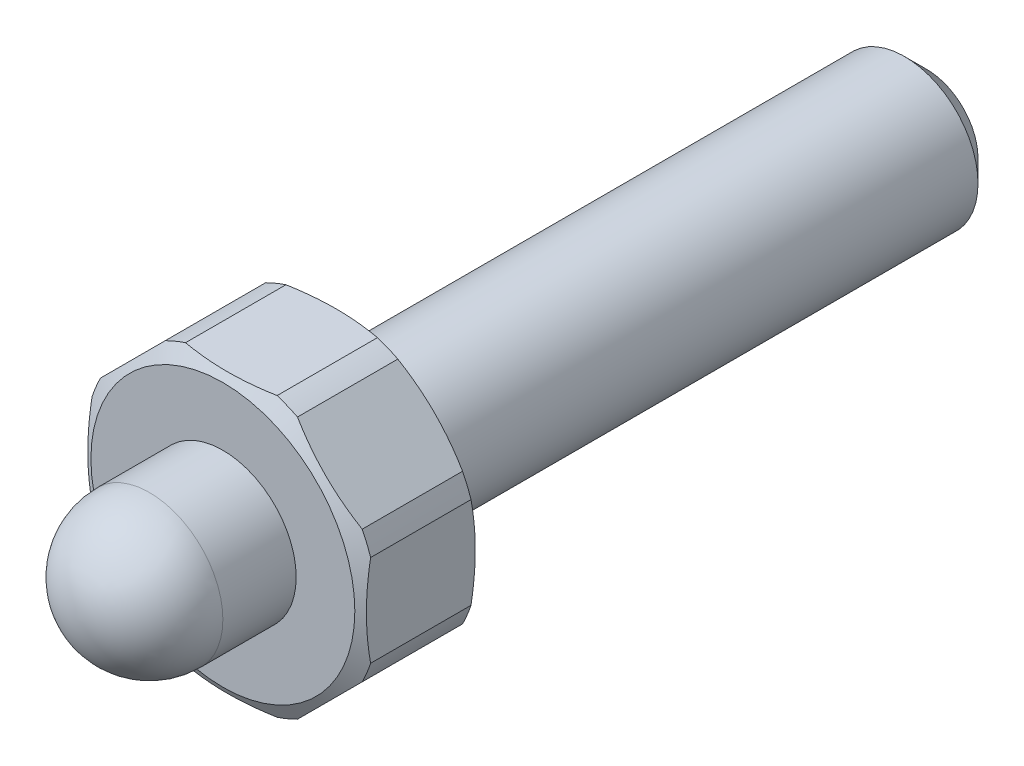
ISO-10303-21;
HEADER;
FILE_DESCRIPTION(('STEP AP214'),'2;1');
FILE_NAME('part.step','',(''),(''),'','','');
FILE_SCHEMA(('AUTOMOTIVE_DESIGN { 1 0 10303 214 1 1 1 1 }'));
ENDSEC;
DATA;
#1=APPLICATION_CONTEXT('core data for automotive mechanical design processes');
#2=APPLICATION_PROTOCOL_DEFINITION('international standard','automotive_design',2000,#1);
#3=PRODUCT_CONTEXT('',#1,'mechanical');
#4=PRODUCT('Part','Part','',(#3));
#5=PRODUCT_RELATED_PRODUCT_CATEGORY('part','',(#4));
#6=PRODUCT_DEFINITION_FORMATION('','',#4);
#7=PRODUCT_DEFINITION_CONTEXT('part definition',#1,'design');
#8=PRODUCT_DEFINITION('design','',#6,#7);
#9=PRODUCT_DEFINITION_SHAPE('','',#8);
#10=(LENGTH_UNIT() NAMED_UNIT(*) SI_UNIT(.MILLI.,.METRE.));
#11=(NAMED_UNIT(*) PLANE_ANGLE_UNIT() SI_UNIT($,.RADIAN.));
#12=(NAMED_UNIT(*) SI_UNIT($,.STERADIAN.) SOLID_ANGLE_UNIT());
#13=UNCERTAINTY_MEASURE_WITH_UNIT(LENGTH_MEASURE(1.E-05),#10,'distance_accuracy_value','');
#14=(GEOMETRIC_REPRESENTATION_CONTEXT(3) GLOBAL_UNCERTAINTY_ASSIGNED_CONTEXT((#13)) GLOBAL_UNIT_ASSIGNED_CONTEXT((#10,
#11,#12)) REPRESENTATION_CONTEXT('',''));
#15=CARTESIAN_POINT('',(0.,0.,0.));
#16=DIRECTION('',(0.,0.,1.));
#17=DIRECTION('',(1.,0.,0.));
#18=AXIS2_PLACEMENT_3D('',#15,#16,#17);
#19=CARTESIAN_POINT('',(-9.5,3.93502884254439,48.));
#20=DIRECTION('',(-0.707106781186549,0.707106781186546,0.));
#21=DIRECTION('',(-0.707106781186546,-0.707106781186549,0.));
#22=AXIS2_PLACEMENT_3D('',#19,#20,#21);
#23=PLANE('',#22);
#24=DIRECTION('',(0.,0.,-1.));
#25=VECTOR('',#24,1.);
#26=CARTESIAN_POINT('',(-4.50957420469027,8.92545463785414,14.1355247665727));
#27=LINE('',#26,#25);
#28=CARTESIAN_POINT('',(-4.50957420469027,8.92545463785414,40.5773502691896));
#29=VERTEX_POINT('',#28);
#30=CARTESIAN_POINT('',(-4.50957420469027,8.92545463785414,47.4226497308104));
#31=VERTEX_POINT('',#30);
#32=EDGE_CURVE('E296',#29,#31,#27,.F.);
#33=ORIENTED_EDGE('',*,*,#32,.F.);
#34=CARTESIAN_POINT('',(-4.50937420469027,8.92565463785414,40.5774012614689));
#35=CARTESIAN_POINT('',(-4.66835968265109,8.76666915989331,40.5368457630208));
#36=CARTESIAN_POINT('',(-4.82785269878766,8.60717614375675,40.5001475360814));
#37=CARTESIAN_POINT('',(-5.14771203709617,8.28731680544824,40.435033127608));
#38=CARTESIAN_POINT('',(-5.30807852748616,8.12695031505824,40.4066186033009));
#39=CARTESIAN_POINT('',(-5.62951126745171,7.8055175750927,40.3586510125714));
#40=CARTESIAN_POINT('',(-5.79057764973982,7.64445119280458,40.3390997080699));
#41=CARTESIAN_POINT('',(-6.11312884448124,7.32189999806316,40.3092762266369));
#42=CARTESIAN_POINT('',(-6.27461362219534,7.16041522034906,40.2990033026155));
#43=CARTESIAN_POINT('',(-6.59553008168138,6.83949876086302,40.2880388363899));
#44=CARTESIAN_POINT('',(-6.75495954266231,6.68006929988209,40.2872178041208));
#45=CARTESIAN_POINT('',(-7.07370784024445,6.36132100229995,40.2948399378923));
#46=CARTESIAN_POINT('',(-7.23302667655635,6.20200216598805,40.3032831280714));
#47=CARTESIAN_POINT('',(-7.55120620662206,5.88382263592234,40.3292431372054));
#48=CARTESIAN_POINT('',(-7.71006709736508,5.72496174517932,40.3467551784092));
#49=CARTESIAN_POINT('',(-8.02717215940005,5.40785668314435,40.3904854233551));
#50=CARTESIAN_POINT('',(-8.18541639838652,5.24961244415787,40.4167026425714));
#51=CARTESIAN_POINT('',(-8.39189944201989,5.0431294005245,40.4563588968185));
#52=CARTESIAN_POINT('',(-8.44050564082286,4.99452320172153,40.4660905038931));
#53=CARTESIAN_POINT('',(-8.53763439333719,4.89739444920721,40.4863137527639));
#54=CARTESIAN_POINT('',(-8.58615695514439,4.8488718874,40.4968053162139));
#55=CARTESIAN_POINT('',(-8.68322448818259,4.7518043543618,40.5185556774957));
#56=CARTESIAN_POINT('',(-8.73176927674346,4.70325956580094,40.5298161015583));
#57=CARTESIAN_POINT('',(-8.82877603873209,4.60625280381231,40.5530663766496));
#58=CARTESIAN_POINT('',(-8.87723800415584,4.55779083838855,40.5650562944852));
#59=CARTESIAN_POINT('',(-8.92565463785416,4.50937420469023,40.5774012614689));
#60=B_SPLINE_CURVE_WITH_KNOTS('',3,(#34,#35,#36,#37,#38,#39,#40,#41,#42,#43,#44,#45,#46,#47,#48,
#49,#50,#51,#52,#53,#54,#55,#56,#57,#58,#59),.UNSPECIFIED.,.F.,.F.,(4,2,2,2,2,2,2,2,2,2,2,2,4),
(0.,0.685401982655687,1.37094099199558,2.05661622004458,2.7422362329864,3.41845195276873,
4.09466943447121,4.77053102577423,5.44631620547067,5.65458890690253,5.86284016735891,
6.07154643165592,6.28027183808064),.UNSPECIFIED.);
#61=CARTESIAN_POINT('',(-8.92545463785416,4.50957420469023,40.5773502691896));
#62=VERTEX_POINT('',#61);
#63=EDGE_CURVE('E220',#29,#62,#60,.T.);
#64=ORIENTED_EDGE('',*,*,#63,.T.);
#65=DIRECTION('',(0.,0.,-1.));
#66=VECTOR('',#65,1.);
#67=CARTESIAN_POINT('',(-8.92545463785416,4.50957420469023,14.1355247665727));
#68=LINE('',#67,#66);
#69=CARTESIAN_POINT('',(-8.92545463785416,4.50957420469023,47.4226497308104));
#70=VERTEX_POINT('',#69);
#71=EDGE_CURVE('E290',#70,#62,#68,.T.);
#72=ORIENTED_EDGE('',*,*,#71,.F.);
#73=CARTESIAN_POINT('',(-8.92565463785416,4.50937420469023,47.422598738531));
#74=CARTESIAN_POINT('',(-8.76666915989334,4.66835968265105,47.4631542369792));
#75=CARTESIAN_POINT('',(-8.60717614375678,4.82785269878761,47.4998524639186));
#76=CARTESIAN_POINT('',(-8.28731680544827,5.14771203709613,47.564966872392));
#77=CARTESIAN_POINT('',(-8.12695031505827,5.30807852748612,47.5933813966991));
#78=CARTESIAN_POINT('',(-7.80551757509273,5.62951126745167,47.6413489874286));
#79=CARTESIAN_POINT('',(-7.64445119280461,5.79057764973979,47.6609002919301));
#80=CARTESIAN_POINT('',(-7.32189999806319,6.11312884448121,47.6907237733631));
#81=CARTESIAN_POINT('',(-7.16041522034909,6.27461362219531,47.7009966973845));
#82=CARTESIAN_POINT('',(-6.83949876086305,6.59553008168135,47.7119611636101));
#83=CARTESIAN_POINT('',(-6.68006929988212,6.75495954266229,47.7127821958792));
#84=CARTESIAN_POINT('',(-6.36132100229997,7.07370784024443,47.7051600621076));
#85=CARTESIAN_POINT('',(-6.20200216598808,7.23302667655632,47.6967168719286));
#86=CARTESIAN_POINT('',(-5.88382263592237,7.55120620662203,47.6707568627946));
#87=CARTESIAN_POINT('',(-5.72496174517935,7.71006709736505,47.6532448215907));
#88=CARTESIAN_POINT('',(-5.40785668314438,8.02717215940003,47.6095145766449));
#89=CARTESIAN_POINT('',(-5.24961244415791,8.18541639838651,47.5832973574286));
#90=CARTESIAN_POINT('',(-5.04312940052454,8.39189944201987,47.5436411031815));
#91=CARTESIAN_POINT('',(-4.99452320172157,8.44050564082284,47.5339094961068));
#92=CARTESIAN_POINT('',(-4.89739444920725,8.53763439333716,47.513686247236));
#93=CARTESIAN_POINT('',(-4.84887188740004,8.58615695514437,47.5031946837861));
#94=CARTESIAN_POINT('',(-4.75180435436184,8.68322448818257,47.4814443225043));
#95=CARTESIAN_POINT('',(-4.70325956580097,8.73176927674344,47.4701838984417));
#96=CARTESIAN_POINT('',(-4.60625280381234,8.82877603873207,47.4469336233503));
#97=CARTESIAN_POINT('',(-4.55779083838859,8.87723800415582,47.4349437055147));
#98=CARTESIAN_POINT('',(-4.50937420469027,8.92565463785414,47.422598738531));
#99=B_SPLINE_CURVE_WITH_KNOTS('',3,(#73,#74,#75,#76,#77,#78,#79,#80,#81,#82,#83,#84,#85,#86,#87,
#88,#89,#90,#91,#92,#93,#94,#95,#96,#97,#98),.UNSPECIFIED.,.F.,.F.,(4,2,2,2,2,2,2,2,2,2,2,2,4),
(0.,0.685401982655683,1.37094099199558,2.05661622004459,2.74223623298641,3.41845195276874,
4.09466943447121,4.77053102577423,5.44631620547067,5.65458890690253,5.86284016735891,
6.07154643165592,6.28027183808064),.UNSPECIFIED.);
#100=EDGE_CURVE('E351',#70,#31,#99,.T.);
#101=ORIENTED_EDGE('',*,*,#100,.T.);
#102=EDGE_LOOP('',(#33,#64,#72,#101));
#103=FACE_BOUND('',#102,.T.);
#104=ADVANCED_FACE('F14',(#103),#23,.T.);
#105=CARTESIAN_POINT('',(-9.5,3.93502884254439,48.));
#106=DIRECTION('',(1.,0.,0.));
#107=DIRECTION('',(0.,1.,0.));
#108=AXIS2_PLACEMENT_3D('',#105,#106,#107);
#109=PLANE('',#108);
#110=CARTESIAN_POINT('',(-9.5,-10.6624370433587,43.0487968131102));
#111=CARTESIAN_POINT('',(-9.5,-10.3273738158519,42.9044090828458));
#112=CARTESIAN_POINT('',(-9.50000000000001,-9.99122686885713,42.762474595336));
#113=CARTESIAN_POINT('',(-9.50000000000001,-9.3163146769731,42.484712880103));
#114=CARTESIAN_POINT('',(-9.50000000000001,-8.97754873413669,42.3488873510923));
#115=CARTESIAN_POINT('',(-9.50000000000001,-8.29520742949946,42.0838778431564));
#116=CARTESIAN_POINT('',(-9.50000000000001,-7.95161570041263,41.9547357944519));
#117=CARTESIAN_POINT('',(-9.50000000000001,-7.26115052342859,41.7055778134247));
#118=CARTESIAN_POINT('',(-9.50000000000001,-6.91427731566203,41.5855612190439));
#119=CARTESIAN_POINT('',(-9.50000000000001,-6.22331422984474,41.35875373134));
#120=CARTESIAN_POINT('',(-9.5,-5.87929160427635,41.2517592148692));
#121=CARTESIAN_POINT('',(-9.5,-5.18743039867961,41.0507161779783));
#122=CARTESIAN_POINT('',(-9.5,-4.83959160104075,40.9566684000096));
#123=CARTESIAN_POINT('',(-9.5,-4.14078802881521,40.784276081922));
#124=CARTESIAN_POINT('',(-9.50000000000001,-3.78983138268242,40.7058988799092));
#125=CARTESIAN_POINT('',(-9.5,-3.08435251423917,40.5673353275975));
#126=CARTESIAN_POINT('',(-9.5,-2.72983101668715,40.5071453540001));
#127=CARTESIAN_POINT('',(-9.5,-2.15429612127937,40.4265856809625));
#128=CARTESIAN_POINT('',(-9.5,-1.93417094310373,40.3997948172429));
#129=CARTESIAN_POINT('',(-9.5,-1.49306719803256,40.3545883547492));
#130=CARTESIAN_POINT('',(-9.5,-1.27208869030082,40.3361721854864));
#131=CARTESIAN_POINT('',(-9.5,-0.829532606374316,40.3080805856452));
#132=CARTESIAN_POINT('',(-9.5,-0.607954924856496,40.2984068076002));
#133=CARTESIAN_POINT('',(-9.5,-0.16458605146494,40.2880074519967));
#134=CARTESIAN_POINT('',(-9.5,0.0572051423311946,40.2872819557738));
#135=CARTESIAN_POINT('',(-9.5,0.501662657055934,40.2948126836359));
#136=CARTESIAN_POINT('',(-9.5,0.724328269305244,40.3031105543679));
#137=CARTESIAN_POINT('',(-9.5,1.1691471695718,40.3285773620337));
#138=CARTESIAN_POINT('',(-9.5,1.3913004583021,40.3457462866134));
#139=CARTESIAN_POINT('',(-9.5,1.83469783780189,40.3885995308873));
#140=CARTESIAN_POINT('',(-9.5,2.055942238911,40.4142806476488));
#141=CARTESIAN_POINT('',(-9.5,2.49736276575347,40.4736713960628));
#142=CARTESIAN_POINT('',(-9.5,2.71753874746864,40.5073820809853));
#143=CARTESIAN_POINT('',(-9.5,3.51025209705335,40.6425771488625));
#144=CARTESIAN_POINT('',(-9.5,4.07919232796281,40.7657750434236));
#145=CARTESIAN_POINT('',(-9.5,4.92487533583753,40.9801462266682));
#146=CARTESIAN_POINT('',(-9.5,5.20558380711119,41.0565659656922));
#147=CARTESIAN_POINT('',(-9.5,5.76454956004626,41.2179339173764));
#148=CARTESIAN_POINT('',(-9.5,6.04280693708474,41.3028817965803));
#149=CARTESIAN_POINT('',(-9.5,6.59836701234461,41.4805394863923));
#150=CARTESIAN_POINT('',(-9.5,6.8756577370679,41.573286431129));
#151=CARTESIAN_POINT('',(-9.5,7.42804912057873,41.7651046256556));
#152=CARTESIAN_POINT('',(-9.5,7.70314968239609,41.8641761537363));
#153=CARTESIAN_POINT('',(-9.5,8.52526532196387,42.1693859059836));
#154=CARTESIAN_POINT('',(-9.5,9.06928948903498,42.3835831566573));
#155=CARTESIAN_POINT('',(-9.5,10.1506278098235,42.8275861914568));
#156=CARTESIAN_POINT('',(-9.5,10.6879442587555,43.0573864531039));
#157=CARTESIAN_POINT('',(-9.5,11.7574593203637,43.5286885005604));
#158=CARTESIAN_POINT('',(-9.5,12.2896574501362,43.7701913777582));
#159=CARTESIAN_POINT('',(-9.5,13.3435311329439,44.2590522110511));
#160=CARTESIAN_POINT('',(-9.49999999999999,13.8652561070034,44.5063040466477));
#161=CARTESIAN_POINT('',(-9.49999999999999,14.6453584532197,44.8821426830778));
#162=CARTESIAN_POINT('',(-9.49999999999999,14.9049441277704,45.0082319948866));
#163=CARTESIAN_POINT('',(-9.49999999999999,15.4233877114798,45.2618905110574));
#164=CARTESIAN_POINT('',(-9.5,15.6822456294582,45.3894596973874));
#165=CARTESIAN_POINT('',(-9.5,15.940781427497,45.5176783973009));
#166=B_SPLINE_CURVE_WITH_KNOTS('',3,(#110,#111,#112,#113,#114,#115,#116,#117,#118,#119,#120,
#121,#122,#123,#124,#125,#126,#127,#128,#129,#130,#131,#132,#133,#134,#135,#136,#137,#138,#139,
#140,#141,#142,#143,#144,#145,#146,#147,#148,#149,#150,#151,#152,#153,#154,#155,#156,#157,#158,
#159,#160,#161,#162,#163,#164,#165),.UNSPECIFIED.,.F.,.F.,(4,2,2,2,2,2,2,2,2,2,2,2,2,2,2,2,2,2,
2,2,2,2,2,2,2,2,2,4),(0.,1.0945752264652,2.18945296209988,3.2905260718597,4.39151922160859,
5.47214107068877,6.55282486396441,7.63123217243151,8.70942449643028,9.37453317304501,
10.0395965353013,10.7047855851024,11.3699806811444,12.0382590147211,12.7065364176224,
13.3745626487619,14.042676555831,15.7867924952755,16.6594939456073,17.5321612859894,
18.4092485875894,19.2863745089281,21.0400108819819,22.7930297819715,24.546212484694,
26.2781943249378,27.1439556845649,28.0097065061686),.UNSPECIFIED.);
#167=CARTESIAN_POINT('',(-9.5,-3.12249899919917,40.5773502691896));
#168=VERTEX_POINT('',#167);
#169=CARTESIAN_POINT('',(-9.5,3.12249899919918,40.5773502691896));
#170=VERTEX_POINT('',#169);
#171=EDGE_CURVE('E127',#168,#170,#166,.T.);
#172=ORIENTED_EDGE('',*,*,#171,.F.);
#173=DIRECTION('',(0.,0.,-1.));
#174=VECTOR('',#173,1.);
#175=CARTESIAN_POINT('',(-9.5,-3.12249899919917,14.1355247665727));
#176=LINE('',#175,#174);
#177=CARTESIAN_POINT('',(-9.5,-3.12249899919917,47.4226497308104));
#178=VERTEX_POINT('',#177);
#179=EDGE_CURVE('E37',#168,#178,#176,.F.);
#180=ORIENTED_EDGE('',*,*,#179,.T.);
#181=CARTESIAN_POINT('',(-9.5,-10.6624370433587,44.9512031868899));
#182=CARTESIAN_POINT('',(-9.5,-10.3273738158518,45.0955909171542));
#183=CARTESIAN_POINT('',(-9.50000000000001,-9.99122686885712,45.237525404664));
#184=CARTESIAN_POINT('',(-9.50000000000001,-9.31631467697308,45.515287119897));
#185=CARTESIAN_POINT('',(-9.50000000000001,-8.97754873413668,45.6511126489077));
#186=CARTESIAN_POINT('',(-9.50000000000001,-8.29520742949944,45.9161221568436));
#187=CARTESIAN_POINT('',(-9.50000000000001,-7.95161570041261,46.0452642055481));
#188=CARTESIAN_POINT('',(-9.50000000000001,-7.26115052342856,46.2944221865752));
#189=CARTESIAN_POINT('',(-9.50000000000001,-6.914277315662,46.4144387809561));
#190=CARTESIAN_POINT('',(-9.50000000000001,-6.22331422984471,46.64124626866));
#191=CARTESIAN_POINT('',(-9.5,-5.87929160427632,46.7482407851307));
#192=CARTESIAN_POINT('',(-9.5,-5.18743039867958,46.9492838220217));
#193=CARTESIAN_POINT('',(-9.5,-4.83959160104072,47.0433315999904));
#194=CARTESIAN_POINT('',(-9.5,-4.14078802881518,47.215723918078));
#195=CARTESIAN_POINT('',(-9.50000000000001,-3.78983138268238,47.2941011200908));
#196=CARTESIAN_POINT('',(-9.5,-3.08435251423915,47.4326646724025));
#197=CARTESIAN_POINT('',(-9.5,-2.72983101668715,47.4928546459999));
#198=CARTESIAN_POINT('',(-9.5,-2.15429612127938,47.5734143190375));
#199=CARTESIAN_POINT('',(-9.5,-1.93417094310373,47.6002051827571));
#200=CARTESIAN_POINT('',(-9.5,-1.49306719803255,47.6454116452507));
#201=CARTESIAN_POINT('',(-9.5,-1.27208869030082,47.6638278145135));
#202=CARTESIAN_POINT('',(-9.5,-0.829532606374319,47.6919194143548));
#203=CARTESIAN_POINT('',(-9.5,-0.607954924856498,47.7015931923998));
#204=CARTESIAN_POINT('',(-9.5,-0.164586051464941,47.7119925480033));
#205=CARTESIAN_POINT('',(-9.5,0.0572051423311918,47.7127180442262));
#206=CARTESIAN_POINT('',(-9.5,0.501662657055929,47.7051873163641));
#207=CARTESIAN_POINT('',(-9.5,0.724328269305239,47.6968894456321));
#208=CARTESIAN_POINT('',(-9.5,1.1691471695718,47.6714226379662));
#209=CARTESIAN_POINT('',(-9.5,1.3913004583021,47.6542537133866));
#210=CARTESIAN_POINT('',(-9.5,1.83469783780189,47.6114004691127));
#211=CARTESIAN_POINT('',(-9.5,2.055942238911,47.5857193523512));
#212=CARTESIAN_POINT('',(-9.5,2.49736276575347,47.5263286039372));
#213=CARTESIAN_POINT('',(-9.5,2.71753874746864,47.4926179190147));
#214=CARTESIAN_POINT('',(-9.5,3.51025209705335,47.3574228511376));
#215=CARTESIAN_POINT('',(-9.5,4.07919232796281,47.2342249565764));
#216=CARTESIAN_POINT('',(-9.5,4.92487533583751,47.0198537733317));
#217=CARTESIAN_POINT('',(-9.5,5.20558380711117,46.9434340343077));
#218=CARTESIAN_POINT('',(-9.5,5.76454956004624,46.7820660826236));
#219=CARTESIAN_POINT('',(-9.5,6.04280693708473,46.6971182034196));
#220=CARTESIAN_POINT('',(-9.5,6.59836701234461,46.5194605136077));
#221=CARTESIAN_POINT('',(-9.5,6.8756577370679,46.426713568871));
#222=CARTESIAN_POINT('',(-9.5,7.42804912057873,46.2348953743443));
#223=CARTESIAN_POINT('',(-9.5,7.70314968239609,46.1358238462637));
#224=CARTESIAN_POINT('',(-9.5,8.52526532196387,45.8306140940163));
#225=CARTESIAN_POINT('',(-9.5,9.06928948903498,45.6164168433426));
#226=CARTESIAN_POINT('',(-9.5,10.1506278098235,45.1724138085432));
#227=CARTESIAN_POINT('',(-9.5,10.6879442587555,44.9426135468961));
#228=CARTESIAN_POINT('',(-9.5,11.7574593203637,44.4713114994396));
#229=CARTESIAN_POINT('',(-9.5,12.2896574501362,44.2298086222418));
#230=CARTESIAN_POINT('',(-9.5,13.3435311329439,43.7409477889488));
#231=CARTESIAN_POINT('',(-9.49999999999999,13.8652561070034,43.4936959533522));
#232=CARTESIAN_POINT('',(-9.49999999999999,14.6453584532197,43.1178573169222));
#233=CARTESIAN_POINT('',(-9.49999999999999,14.9049441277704,42.9917680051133));
#234=CARTESIAN_POINT('',(-9.49999999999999,15.4233877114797,42.7381094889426));
#235=CARTESIAN_POINT('',(-9.5,15.6822456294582,42.6105403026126));
#236=CARTESIAN_POINT('',(-9.5,15.940781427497,42.4823216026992));
#237=B_SPLINE_CURVE_WITH_KNOTS('',3,(#181,#182,#183,#184,#185,#186,#187,#188,#189,#190,#191,
#192,#193,#194,#195,#196,#197,#198,#199,#200,#201,#202,#203,#204,#205,#206,#207,#208,#209,#210,
#211,#212,#213,#214,#215,#216,#217,#218,#219,#220,#221,#222,#223,#224,#225,#226,#227,#228,#229,
#230,#231,#232,#233,#234,#235,#236),.UNSPECIFIED.,.F.,.F.,(4,2,2,2,2,2,2,2,2,2,2,2,2,2,2,2,2,2,
2,2,2,2,2,2,2,2,2,4),(0.,1.09457522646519,2.18945296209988,3.29052607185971,4.3915192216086,
5.47214107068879,6.55282486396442,7.63123217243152,8.70942449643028,9.374533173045,
10.0395965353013,10.7047855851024,11.3699806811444,12.0382590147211,12.7065364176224,
13.3745626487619,14.042676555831,15.7867924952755,16.6594939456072,17.5321612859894,
18.4092485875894,19.2863745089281,21.0400108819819,22.7930297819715,24.546212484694,
26.2781943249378,27.1439556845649,28.0097065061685),.UNSPECIFIED.);
#238=CARTESIAN_POINT('',(-9.5,3.12249899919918,47.4226497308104));
#239=VERTEX_POINT('',#238);
#240=EDGE_CURVE('E331',#239,#178,#237,.F.);
#241=ORIENTED_EDGE('',*,*,#240,.F.);
#242=DIRECTION('',(0.,0.,-1.));
#243=VECTOR('',#242,1.);
#244=CARTESIAN_POINT('',(-9.5,3.12249899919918,14.1355247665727));
#245=LINE('',#244,#243);
#246=EDGE_CURVE('E137',#239,#170,#245,.T.);
#247=ORIENTED_EDGE('',*,*,#246,.T.);
#248=EDGE_LOOP('',(#172,#180,#241,#247));
#249=FACE_BOUND('',#248,.T.);
#250=ADVANCED_FACE('F135',(#249),#109,.F.);
#251=CARTESIAN_POINT('',(-9.5,-3.93502884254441,48.));
#252=DIRECTION('',(0.707106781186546,0.707106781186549,0.));
#253=DIRECTION('',(-0.707106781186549,0.707106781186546,0.));
#254=AXIS2_PLACEMENT_3D('',#251,#252,#253);
#255=PLANE('',#254);
#256=CARTESIAN_POINT('',(-4.50937420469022,-8.92565463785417,40.5774012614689));
#257=CARTESIAN_POINT('',(-4.66835968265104,-8.76666915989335,40.5368457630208));
#258=CARTESIAN_POINT('',(-4.82785269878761,-8.60717614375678,40.5001475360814));
#259=CARTESIAN_POINT('',(-5.14771203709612,-8.28731680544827,40.435033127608));
#260=CARTESIAN_POINT('',(-5.30807852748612,-8.12695031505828,40.4066186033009));
#261=CARTESIAN_POINT('',(-5.62951126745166,-7.80551757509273,40.3586510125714));
#262=CARTESIAN_POINT('',(-5.79057764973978,-7.64445119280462,40.3390997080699));
#263=CARTESIAN_POINT('',(-6.1131288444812,-7.3218999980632,40.3092762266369));
#264=CARTESIAN_POINT('',(-6.27461362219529,-7.1604152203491,40.2990033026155));
#265=CARTESIAN_POINT('',(-6.59553008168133,-6.83949876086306,40.2880388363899));
#266=CARTESIAN_POINT('',(-6.75495954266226,-6.68006929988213,40.2872178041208));
#267=CARTESIAN_POINT('',(-7.07370784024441,-6.36132100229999,40.2948399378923));
#268=CARTESIAN_POINT('',(-7.2330266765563,-6.2020021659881,40.3032831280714));
#269=CARTESIAN_POINT('',(-7.55120620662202,-5.88382263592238,40.3292431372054));
#270=CARTESIAN_POINT('',(-7.71006709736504,-5.72496174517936,40.3467551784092));
#271=CARTESIAN_POINT('',(-8.02717215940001,-5.4078566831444,40.3904854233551));
#272=CARTESIAN_POINT('',(-8.18541639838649,-5.24961244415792,40.4167026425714));
#273=CARTESIAN_POINT('',(-8.39189944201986,-5.04312940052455,40.4563588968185));
#274=CARTESIAN_POINT('',(-8.44050564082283,-4.99452320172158,40.4660905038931));
#275=CARTESIAN_POINT('',(-8.53763439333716,-4.89739444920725,40.4863137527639));
#276=CARTESIAN_POINT('',(-8.58615695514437,-4.84887188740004,40.4968053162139));
#277=CARTESIAN_POINT('',(-8.68322448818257,-4.75180435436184,40.5185556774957));
#278=CARTESIAN_POINT('',(-8.73176927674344,-4.70325956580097,40.5298161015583));
#279=CARTESIAN_POINT('',(-8.82877603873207,-4.60625280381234,40.5530663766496));
#280=CARTESIAN_POINT('',(-8.87723800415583,-4.55779083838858,40.5650562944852));
#281=CARTESIAN_POINT('',(-8.92565463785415,-4.50937420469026,40.5774012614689));
#282=B_SPLINE_CURVE_WITH_KNOTS('',3,(#256,#257,#258,#259,#260,#261,#262,#263,#264,#265,#266,
#267,#268,#269,#270,#271,#272,#273,#274,#275,#276,#277,#278,#279,#280,#281),.UNSPECIFIED.,.F.,
.F.,(4,2,2,2,2,2,2,2,2,2,2,2,4),(0.,0.685401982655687,1.37094099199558,2.05661622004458,
2.7422362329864,3.41845195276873,4.0946694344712,4.77053102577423,5.44631620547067,
5.65458890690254,5.86284016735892,6.07154643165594,6.28027183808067),.UNSPECIFIED.);
#283=CARTESIAN_POINT('',(-4.50957420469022,-8.92545463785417,40.5773502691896));
#284=VERTEX_POINT('',#283);
#285=CARTESIAN_POINT('',(-8.92545463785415,-4.50957420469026,40.5773502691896));
#286=VERTEX_POINT('',#285);
#287=EDGE_CURVE('E29',#284,#286,#282,.T.);
#288=ORIENTED_EDGE('',*,*,#287,.F.);
#289=DIRECTION('',(0.,0.,-1.));
#290=VECTOR('',#289,1.);
#291=CARTESIAN_POINT('',(-4.50957420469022,-8.92545463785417,14.1355247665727));
#292=LINE('',#291,#290);
#293=CARTESIAN_POINT('',(-4.50957420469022,-8.92545463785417,47.4226497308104));
#294=VERTEX_POINT('',#293);
#295=EDGE_CURVE('E148',#284,#294,#292,.F.);
#296=ORIENTED_EDGE('',*,*,#295,.T.);
#297=CARTESIAN_POINT('',(-8.92565463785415,-4.50937420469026,47.422598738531));
#298=CARTESIAN_POINT('',(-8.76666915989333,-4.66835968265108,47.4631542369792));
#299=CARTESIAN_POINT('',(-8.60717614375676,-4.82785269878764,47.4998524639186));
#300=CARTESIAN_POINT('',(-8.28731680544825,-5.14771203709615,47.564966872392));
#301=CARTESIAN_POINT('',(-8.12695031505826,-5.30807852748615,47.5933813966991));
#302=CARTESIAN_POINT('',(-7.80551757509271,-5.62951126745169,47.6413489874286));
#303=CARTESIAN_POINT('',(-7.64445119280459,-5.79057764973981,47.6609002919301));
#304=CARTESIAN_POINT('',(-7.32189999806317,-6.11312884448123,47.6907237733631));
#305=CARTESIAN_POINT('',(-7.16041522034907,-6.27461362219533,47.7009966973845));
#306=CARTESIAN_POINT('',(-6.83949876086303,-6.59553008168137,47.7119611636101));
#307=CARTESIAN_POINT('',(-6.6800692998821,-6.7549595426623,47.7127821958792));
#308=CARTESIAN_POINT('',(-6.36132100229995,-7.07370784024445,47.7051600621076));
#309=CARTESIAN_POINT('',(-6.20200216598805,-7.23302667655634,47.6967168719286));
#310=CARTESIAN_POINT('',(-5.88382263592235,-7.55120620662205,47.6707568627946));
#311=CARTESIAN_POINT('',(-5.72496174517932,-7.71006709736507,47.6532448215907));
#312=CARTESIAN_POINT('',(-5.40785668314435,-8.02717215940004,47.6095145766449));
#313=CARTESIAN_POINT('',(-5.24961244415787,-8.18541639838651,47.5832973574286));
#314=CARTESIAN_POINT('',(-5.04312940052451,-8.39189944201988,47.5436411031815));
#315=CARTESIAN_POINT('',(-4.99452320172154,-8.44050564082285,47.5339094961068));
#316=CARTESIAN_POINT('',(-4.89739444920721,-8.53763439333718,47.513686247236));
#317=CARTESIAN_POINT('',(-4.8488718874,-8.58615695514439,47.5031946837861));
#318=CARTESIAN_POINT('',(-4.7518043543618,-8.68322448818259,47.4814443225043));
#319=CARTESIAN_POINT('',(-4.70325956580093,-8.73176927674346,47.4701838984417));
#320=CARTESIAN_POINT('',(-4.6062528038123,-8.82877603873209,47.4469336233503));
#321=CARTESIAN_POINT('',(-4.55779083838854,-8.87723800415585,47.4349437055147));
#322=CARTESIAN_POINT('',(-4.50937420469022,-8.92565463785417,47.422598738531));
#323=B_SPLINE_CURVE_WITH_KNOTS('',3,(#297,#298,#299,#300,#301,#302,#303,#304,#305,#306,#307,
#308,#309,#310,#311,#312,#313,#314,#315,#316,#317,#318,#319,#320,#321,#322),.UNSPECIFIED.,.F.,
.F.,(4,2,2,2,2,2,2,2,2,2,2,2,4),(0.,0.685401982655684,1.37094099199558,2.05661622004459,
2.74223623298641,3.41845195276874,4.09466943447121,4.77053102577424,5.44631620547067,
5.65458890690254,5.86284016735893,6.07154643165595,6.28027183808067),.UNSPECIFIED.);
#324=CARTESIAN_POINT('',(-8.92545463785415,-4.50957420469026,47.4226497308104));
#325=VERTEX_POINT('',#324);
#326=EDGE_CURVE('E323',#325,#294,#323,.T.);
#327=ORIENTED_EDGE('',*,*,#326,.F.);
#328=DIRECTION('',(0.,0.,-1.));
#329=VECTOR('',#328,1.);
#330=CARTESIAN_POINT('',(-8.92545463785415,-4.50957420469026,14.1355247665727));
#331=LINE('',#330,#329);
#332=EDGE_CURVE('E143',#325,#286,#331,.T.);
#333=ORIENTED_EDGE('',*,*,#332,.T.);
#334=EDGE_LOOP('',(#288,#296,#327,#333));
#335=FACE_BOUND('',#334,.T.);
#336=ADVANCED_FACE('F195',(#335),#255,.F.);
#337=CARTESIAN_POINT('',(3.93502884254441,-9.5,48.));
#338=DIRECTION('',(0.,-1.,0.));
#339=DIRECTION('',(0.,0.,-1.));
#340=AXIS2_PLACEMENT_3D('',#337,#338,#339);
#341=PLANE('',#340);
#342=DIRECTION('',(0.,0.,-1.));
#343=VECTOR('',#342,1.);
#344=CARTESIAN_POINT('',(-3.12249899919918,-9.5,14.1355247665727));
#345=LINE('',#344,#343);
#346=CARTESIAN_POINT('',(-3.12249899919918,-9.5,40.5773502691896));
#347=VERTEX_POINT('',#346);
#348=CARTESIAN_POINT('',(-3.12249899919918,-9.5,47.4226497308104));
#349=VERTEX_POINT('',#348);
#350=EDGE_CURVE('E318',#347,#349,#345,.F.);
#351=ORIENTED_EDGE('',*,*,#350,.F.);
#352=CARTESIAN_POINT('',(-10.6624370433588,-9.5,43.0487968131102));
#353=CARTESIAN_POINT('',(-10.3273738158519,-9.5,42.9044090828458));
#354=CARTESIAN_POINT('',(-9.99122686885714,-9.5,42.762474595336));
#355=CARTESIAN_POINT('',(-9.31631467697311,-9.5,42.484712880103));
#356=CARTESIAN_POINT('',(-8.9775487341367,-9.5,42.3488873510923));
#357=CARTESIAN_POINT('',(-8.29520742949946,-9.5,42.0838778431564));
#358=CARTESIAN_POINT('',(-7.95161570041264,-9.5,41.9547357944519));
#359=CARTESIAN_POINT('',(-7.2611505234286,-9.5,41.7055778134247));
#360=CARTESIAN_POINT('',(-6.91427731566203,-9.5,41.5855612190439));
#361=CARTESIAN_POINT('',(-6.22331422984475,-9.5,41.35875373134));
#362=CARTESIAN_POINT('',(-5.87929160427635,-9.5,41.2517592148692));
#363=CARTESIAN_POINT('',(-5.18743039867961,-9.5,41.0507161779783));
#364=CARTESIAN_POINT('',(-4.83959160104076,-9.5,40.9566684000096));
#365=CARTESIAN_POINT('',(-4.14078802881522,-9.5,40.784276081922));
#366=CARTESIAN_POINT('',(-3.78983138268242,-9.5,40.7058988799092));
#367=CARTESIAN_POINT('',(-3.08435251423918,-9.5,40.5673353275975));
#368=CARTESIAN_POINT('',(-2.72983101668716,-9.5,40.5071453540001));
#369=CARTESIAN_POINT('',(-2.15429612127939,-9.5,40.4265856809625));
#370=CARTESIAN_POINT('',(-1.93417094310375,-9.5,40.3997948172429));
#371=CARTESIAN_POINT('',(-1.49306719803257,-9.5,40.3545883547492));
#372=CARTESIAN_POINT('',(-1.27208869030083,-9.5,40.3361721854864));
#373=CARTESIAN_POINT('',(-0.829532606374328,-9.5,40.3080805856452));
#374=CARTESIAN_POINT('',(-0.607954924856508,-9.5,40.2984068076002));
#375=CARTESIAN_POINT('',(-0.164586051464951,-9.5,40.2880074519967));
#376=CARTESIAN_POINT('',(0.0572051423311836,-9.5,40.2872819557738));
#377=CARTESIAN_POINT('',(0.501662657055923,-9.5,40.2948126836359));
#378=CARTESIAN_POINT('',(0.724328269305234,-9.5,40.3031105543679));
#379=CARTESIAN_POINT('',(1.16914716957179,-9.5,40.3285773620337));
#380=CARTESIAN_POINT('',(1.39130045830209,-9.5,40.3457462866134));
#381=CARTESIAN_POINT('',(1.83469783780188,-9.5,40.3885995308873));
#382=CARTESIAN_POINT('',(2.055942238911,-9.5,40.4142806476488));
#383=CARTESIAN_POINT('',(2.49736276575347,-9.5,40.4736713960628));
#384=CARTESIAN_POINT('',(2.71753874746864,-9.5,40.5073820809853));
#385=CARTESIAN_POINT('',(3.51025209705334,-9.5,40.6425771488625));
#386=CARTESIAN_POINT('',(4.07919232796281,-9.5,40.7657750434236));
#387=CARTESIAN_POINT('',(4.92487533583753,-9.5,40.9801462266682));
#388=CARTESIAN_POINT('',(5.20558380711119,-9.5,41.0565659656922));
#389=CARTESIAN_POINT('',(5.76454956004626,-9.5,41.2179339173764));
#390=CARTESIAN_POINT('',(6.04280693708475,-9.5,41.3028817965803));
#391=CARTESIAN_POINT('',(6.59836701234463,-9.5,41.4805394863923));
#392=CARTESIAN_POINT('',(6.87565773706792,-9.5,41.573286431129));
#393=CARTESIAN_POINT('',(7.42804912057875,-9.5,41.7651046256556));
#394=CARTESIAN_POINT('',(7.70314968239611,-9.5,41.8641761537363));
#395=CARTESIAN_POINT('',(8.52526532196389,-9.5,42.1693859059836));
#396=CARTESIAN_POINT('',(9.06928948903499,-9.5,42.3835831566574));
#397=CARTESIAN_POINT('',(10.1506278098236,-9.5,42.8275861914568));
#398=CARTESIAN_POINT('',(10.6879442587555,-9.5,43.0573864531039));
#399=CARTESIAN_POINT('',(11.7574593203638,-9.5,43.5286885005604));
#400=CARTESIAN_POINT('',(12.2896574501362,-9.5,43.7701913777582));
#401=CARTESIAN_POINT('',(13.3435311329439,-9.5,44.2590522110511));
#402=CARTESIAN_POINT('',(13.8652561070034,-9.5,44.5063040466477));
#403=CARTESIAN_POINT('',(14.6453584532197,-9.5,44.8821426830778));
#404=CARTESIAN_POINT('',(14.9049441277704,-9.5,45.0082319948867));
#405=CARTESIAN_POINT('',(15.4233877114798,-9.5,45.2618905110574));
#406=CARTESIAN_POINT('',(15.6822456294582,-9.5,45.3894596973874));
#407=CARTESIAN_POINT('',(15.940781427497,-9.5,45.5176783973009));
#408=B_SPLINE_CURVE_WITH_KNOTS('',3,(#352,#353,#354,#355,#356,#357,#358,#359,#360,#361,#362,
#363,#364,#365,#366,#367,#368,#369,#370,#371,#372,#373,#374,#375,#376,#377,#378,#379,#380,#381,
#382,#383,#384,#385,#386,#387,#388,#389,#390,#391,#392,#393,#394,#395,#396,#397,#398,#399,#400,
#401,#402,#403,#404,#405,#406,#407),.UNSPECIFIED.,.F.,.F.,(4,2,2,2,2,2,2,2,2,2,2,2,2,2,2,2,2,2,
2,2,2,2,2,2,2,2,2,4),(0.,1.0945752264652,2.18945296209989,3.29052607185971,4.3915192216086,
5.47214107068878,6.55282486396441,7.63123217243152,8.70942449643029,9.37453317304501,
10.0395965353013,10.7047855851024,11.3699806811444,12.0382590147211,12.7065364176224,
13.3745626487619,14.042676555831,15.7867924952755,16.6594939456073,17.5321612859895,
18.4092485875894,19.2863745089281,21.0400108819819,22.7930297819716,24.546212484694,
26.2781943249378,27.1439556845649,28.0097065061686),.UNSPECIFIED.);
#409=CARTESIAN_POINT('',(3.12249899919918,-9.5,40.5773502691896));
#410=VERTEX_POINT('',#409);
#411=EDGE_CURVE('E212',#347,#410,#408,.T.);
#412=ORIENTED_EDGE('',*,*,#411,.T.);
#413=DIRECTION('',(0.,0.,-1.));
#414=VECTOR('',#413,1.);
#415=CARTESIAN_POINT('',(3.12249899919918,-9.5,14.1355247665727));
#416=LINE('',#415,#414);
#417=CARTESIAN_POINT('',(3.12249899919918,-9.5,47.4226497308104));
#418=VERTEX_POINT('',#417);
#419=EDGE_CURVE('E315',#418,#410,#416,.T.);
#420=ORIENTED_EDGE('',*,*,#419,.F.);
#421=CARTESIAN_POINT('',(-10.6624370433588,-9.5,44.9512031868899));
#422=CARTESIAN_POINT('',(-10.3273738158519,-9.5,45.0955909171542));
#423=CARTESIAN_POINT('',(-9.99122686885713,-9.5,45.237525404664));
#424=CARTESIAN_POINT('',(-9.31631467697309,-9.5,45.515287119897));
#425=CARTESIAN_POINT('',(-8.97754873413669,-9.5,45.6511126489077));
#426=CARTESIAN_POINT('',(-8.29520742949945,-9.5,45.9161221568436));
#427=CARTESIAN_POINT('',(-7.95161570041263,-9.5,46.0452642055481));
#428=CARTESIAN_POINT('',(-7.26115052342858,-9.5,46.2944221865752));
#429=CARTESIAN_POINT('',(-6.91427731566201,-9.5,46.4144387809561));
#430=CARTESIAN_POINT('',(-6.22331422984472,-9.5,46.64124626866));
#431=CARTESIAN_POINT('',(-5.87929160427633,-9.5,46.7482407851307));
#432=CARTESIAN_POINT('',(-5.18743039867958,-9.5,46.9492838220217));
#433=CARTESIAN_POINT('',(-4.83959160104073,-9.5,47.0433315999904));
#434=CARTESIAN_POINT('',(-4.14078802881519,-9.5,47.215723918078));
#435=CARTESIAN_POINT('',(-3.78983138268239,-9.5,47.2941011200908));
#436=CARTESIAN_POINT('',(-3.08435251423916,-9.5,47.4326646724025));
#437=CARTESIAN_POINT('',(-2.72983101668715,-9.5,47.4928546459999));
#438=CARTESIAN_POINT('',(-2.15429612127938,-9.5,47.5734143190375));
#439=CARTESIAN_POINT('',(-1.93417094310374,-9.5,47.6002051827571));
#440=CARTESIAN_POINT('',(-1.49306719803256,-9.5,47.6454116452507));
#441=CARTESIAN_POINT('',(-1.27208869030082,-9.5,47.6638278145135));
#442=CARTESIAN_POINT('',(-0.829532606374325,-9.5,47.6919194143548));
#443=CARTESIAN_POINT('',(-0.607954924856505,-9.5,47.7015931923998));
#444=CARTESIAN_POINT('',(-0.164586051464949,-9.5,47.7119925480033));
#445=CARTESIAN_POINT('',(0.0572051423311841,-9.5,47.7127180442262));
#446=CARTESIAN_POINT('',(0.501662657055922,-9.5,47.7051873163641));
#447=CARTESIAN_POINT('',(0.724328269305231,-9.5,47.6968894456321));
#448=CARTESIAN_POINT('',(1.16914716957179,-9.5,47.6714226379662));
#449=CARTESIAN_POINT('',(1.39130045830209,-9.5,47.6542537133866));
#450=CARTESIAN_POINT('',(1.83469783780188,-9.5,47.6114004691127));
#451=CARTESIAN_POINT('',(2.05594223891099,-9.5,47.5857193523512));
#452=CARTESIAN_POINT('',(2.49736276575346,-9.5,47.5263286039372));
#453=CARTESIAN_POINT('',(2.71753874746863,-9.5,47.4926179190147));
#454=CARTESIAN_POINT('',(3.51025209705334,-9.5,47.3574228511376));
#455=CARTESIAN_POINT('',(4.07919232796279,-9.5,47.2342249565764));
#456=CARTESIAN_POINT('',(4.9248753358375,-9.5,47.0198537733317));
#457=CARTESIAN_POINT('',(5.20558380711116,-9.5,46.9434340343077));
#458=CARTESIAN_POINT('',(5.76454956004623,-9.5,46.7820660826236));
#459=CARTESIAN_POINT('',(6.04280693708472,-9.5,46.6971182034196));
#460=CARTESIAN_POINT('',(6.5983670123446,-9.5,46.5194605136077));
#461=CARTESIAN_POINT('',(6.87565773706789,-9.5,46.426713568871));
#462=CARTESIAN_POINT('',(7.42804912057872,-9.5,46.2348953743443));
#463=CARTESIAN_POINT('',(7.70314968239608,-9.5,46.1358238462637));
#464=CARTESIAN_POINT('',(8.52526532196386,-9.5,45.8306140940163));
#465=CARTESIAN_POINT('',(9.06928948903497,-9.5,45.6164168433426));
#466=CARTESIAN_POINT('',(10.1506278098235,-9.5,45.1724138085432));
#467=CARTESIAN_POINT('',(10.6879442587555,-9.5,44.9426135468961));
#468=CARTESIAN_POINT('',(11.7574593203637,-9.5,44.4713114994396));
#469=CARTESIAN_POINT('',(12.2896574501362,-9.5,44.2298086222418));
#470=CARTESIAN_POINT('',(13.3435311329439,-9.5,43.7409477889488));
#471=CARTESIAN_POINT('',(13.8652561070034,-9.5,43.4936959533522));
#472=CARTESIAN_POINT('',(14.6453584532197,-9.5,43.1178573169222));
#473=CARTESIAN_POINT('',(14.9049441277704,-9.5,42.9917680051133));
#474=CARTESIAN_POINT('',(15.4233877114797,-9.5,42.7381094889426));
#475=CARTESIAN_POINT('',(15.6822456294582,-9.5,42.6105403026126));
#476=CARTESIAN_POINT('',(15.940781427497,-9.5,42.4823216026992));
#477=B_SPLINE_CURVE_WITH_KNOTS('',3,(#421,#422,#423,#424,#425,#426,#427,#428,#429,#430,#431,
#432,#433,#434,#435,#436,#437,#438,#439,#440,#441,#442,#443,#444,#445,#446,#447,#448,#449,#450,
#451,#452,#453,#454,#455,#456,#457,#458,#459,#460,#461,#462,#463,#464,#465,#466,#467,#468,#469,
#470,#471,#472,#473,#474,#475,#476),.UNSPECIFIED.,.F.,.F.,(4,2,2,2,2,2,2,2,2,2,2,2,2,2,2,2,2,2,
2,2,2,2,2,2,2,2,2,4),(0.,1.0945752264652,2.18945296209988,3.29052607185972,4.39151922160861,
5.47214107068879,6.55282486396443,7.63123217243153,8.70942449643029,9.37453317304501,
10.0395965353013,10.7047855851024,11.3699806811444,12.0382590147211,12.7065364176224,
13.3745626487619,14.042676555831,15.7867924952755,16.6594939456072,17.5321612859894,
18.4092485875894,19.2863745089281,21.0400108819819,22.7930297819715,24.546212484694,
26.2781943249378,27.1439556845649,28.0097065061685),.UNSPECIFIED.);
#478=EDGE_CURVE('E338',#418,#349,#477,.F.);
#479=ORIENTED_EDGE('',*,*,#478,.T.);
#480=EDGE_LOOP('',(#351,#412,#420,#479));
#481=FACE_BOUND('',#480,.T.);
#482=ADVANCED_FACE('F357',(#481),#341,.T.);
#483=CARTESIAN_POINT('',(3.93502884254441,-9.5,48.));
#484=DIRECTION('',(-0.707106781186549,0.707106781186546,0.));
#485=DIRECTION('',(-0.707106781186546,-0.707106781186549,0.));
#486=AXIS2_PLACEMENT_3D('',#483,#484,#485);
#487=PLANE('',#486);
#488=CARTESIAN_POINT('',(8.92565463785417,-4.50937420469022,40.5774012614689));
#489=CARTESIAN_POINT('',(8.76666915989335,-4.66835968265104,40.5368457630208));
#490=CARTESIAN_POINT('',(8.60717614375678,-4.82785269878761,40.5001475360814));
#491=CARTESIAN_POINT('',(8.28731680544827,-5.14771203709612,40.435033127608));
#492=CARTESIAN_POINT('',(8.12695031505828,-5.30807852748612,40.4066186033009));
#493=CARTESIAN_POINT('',(7.80551757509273,-5.62951126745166,40.3586510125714));
#494=CARTESIAN_POINT('',(7.64445119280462,-5.79057764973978,40.3390997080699));
#495=CARTESIAN_POINT('',(7.3218999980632,-6.1131288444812,40.3092762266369));
#496=CARTESIAN_POINT('',(7.1604152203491,-6.27461362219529,40.2990033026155));
#497=CARTESIAN_POINT('',(6.83949876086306,-6.59553008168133,40.2880388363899));
#498=CARTESIAN_POINT('',(6.68006929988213,-6.75495954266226,40.2872178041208));
#499=CARTESIAN_POINT('',(6.36132100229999,-7.07370784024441,40.2948399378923));
#500=CARTESIAN_POINT('',(6.2020021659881,-7.2330266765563,40.3032831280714));
#501=CARTESIAN_POINT('',(5.88382263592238,-7.55120620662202,40.3292431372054));
#502=CARTESIAN_POINT('',(5.72496174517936,-7.71006709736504,40.3467551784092));
#503=CARTESIAN_POINT('',(5.4078566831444,-8.02717215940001,40.3904854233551));
#504=CARTESIAN_POINT('',(5.24961244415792,-8.18541639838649,40.4167026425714));
#505=CARTESIAN_POINT('',(5.04312940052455,-8.39189944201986,40.4563588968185));
#506=CARTESIAN_POINT('',(4.99452320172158,-8.44050564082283,40.4660905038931));
#507=CARTESIAN_POINT('',(4.89739444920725,-8.53763439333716,40.4863137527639));
#508=CARTESIAN_POINT('',(4.84887188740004,-8.58615695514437,40.4968053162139));
#509=CARTESIAN_POINT('',(4.75180435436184,-8.68322448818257,40.5185556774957));
#510=CARTESIAN_POINT('',(4.70325956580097,-8.73176927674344,40.5298161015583));
#511=CARTESIAN_POINT('',(4.60625280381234,-8.82877603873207,40.5530663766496));
#512=CARTESIAN_POINT('',(4.55779083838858,-8.87723800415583,40.5650562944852));
#513=CARTESIAN_POINT('',(4.50937420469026,-8.92565463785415,40.5774012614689));
#514=B_SPLINE_CURVE_WITH_KNOTS('',3,(#488,#489,#490,#491,#492,#493,#494,#495,#496,#497,#498,
#499,#500,#501,#502,#503,#504,#505,#506,#507,#508,#509,#510,#511,#512,#513),.UNSPECIFIED.,.F.,
.F.,(4,2,2,2,2,2,2,2,2,2,2,2,4),(0.,0.685401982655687,1.37094099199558,2.05661622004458,
2.7422362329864,3.41845195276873,4.0946694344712,4.77053102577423,5.44631620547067,
5.65458890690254,5.86284016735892,6.07154643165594,6.28027183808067),.UNSPECIFIED.);
#515=CARTESIAN_POINT('',(8.92545463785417,-4.50957420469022,40.5773502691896));
#516=VERTEX_POINT('',#515);
#517=CARTESIAN_POINT('',(4.50957420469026,-8.92545463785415,40.5773502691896));
#518=VERTEX_POINT('',#517);
#519=EDGE_CURVE('E237',#516,#518,#514,.T.);
#520=ORIENTED_EDGE('',*,*,#519,.F.);
#521=DIRECTION('',(0.,0.,-1.));
#522=VECTOR('',#521,1.);
#523=CARTESIAN_POINT('',(8.92545463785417,-4.50957420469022,14.1355247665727));
#524=LINE('',#523,#522);
#525=CARTESIAN_POINT('',(8.92545463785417,-4.50957420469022,47.4226497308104));
#526=VERTEX_POINT('',#525);
#527=EDGE_CURVE('E310',#516,#526,#524,.F.);
#528=ORIENTED_EDGE('',*,*,#527,.T.);
#529=CARTESIAN_POINT('',(4.50937420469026,-8.92565463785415,47.422598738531));
#530=CARTESIAN_POINT('',(4.66835968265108,-8.76666915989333,47.4631542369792));
#531=CARTESIAN_POINT('',(4.82785269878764,-8.60717614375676,47.4998524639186));
#532=CARTESIAN_POINT('',(5.14771203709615,-8.28731680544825,47.564966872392));
#533=CARTESIAN_POINT('',(5.30807852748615,-8.12695031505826,47.5933813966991));
#534=CARTESIAN_POINT('',(5.62951126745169,-7.80551757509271,47.6413489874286));
#535=CARTESIAN_POINT('',(5.79057764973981,-7.64445119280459,47.6609002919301));
#536=CARTESIAN_POINT('',(6.11312884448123,-7.32189999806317,47.6907237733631));
#537=CARTESIAN_POINT('',(6.27461362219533,-7.16041522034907,47.7009966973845));
#538=CARTESIAN_POINT('',(6.59553008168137,-6.83949876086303,47.7119611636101));
#539=CARTESIAN_POINT('',(6.7549595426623,-6.6800692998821,47.7127821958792));
#540=CARTESIAN_POINT('',(7.07370784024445,-6.36132100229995,47.7051600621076));
#541=CARTESIAN_POINT('',(7.23302667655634,-6.20200216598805,47.6967168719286));
#542=CARTESIAN_POINT('',(7.55120620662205,-5.88382263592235,47.6707568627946));
#543=CARTESIAN_POINT('',(7.71006709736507,-5.72496174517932,47.6532448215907));
#544=CARTESIAN_POINT('',(8.02717215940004,-5.40785668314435,47.6095145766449));
#545=CARTESIAN_POINT('',(8.18541639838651,-5.24961244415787,47.5832973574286));
#546=CARTESIAN_POINT('',(8.39189944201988,-5.04312940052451,47.5436411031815));
#547=CARTESIAN_POINT('',(8.44050564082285,-4.99452320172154,47.5339094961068));
#548=CARTESIAN_POINT('',(8.53763439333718,-4.89739444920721,47.513686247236));
#549=CARTESIAN_POINT('',(8.58615695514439,-4.8488718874,47.5031946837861));
#550=CARTESIAN_POINT('',(8.68322448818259,-4.7518043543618,47.4814443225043));
#551=CARTESIAN_POINT('',(8.73176927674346,-4.70325956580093,47.4701838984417));
#552=CARTESIAN_POINT('',(8.82877603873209,-4.6062528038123,47.4469336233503));
#553=CARTESIAN_POINT('',(8.87723800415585,-4.55779083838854,47.4349437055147));
#554=CARTESIAN_POINT('',(8.92565463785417,-4.50937420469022,47.422598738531));
#555=B_SPLINE_CURVE_WITH_KNOTS('',3,(#529,#530,#531,#532,#533,#534,#535,#536,#537,#538,#539,
#540,#541,#542,#543,#544,#545,#546,#547,#548,#549,#550,#551,#552,#553,#554),.UNSPECIFIED.,.F.,
.F.,(4,2,2,2,2,2,2,2,2,2,2,2,4),(0.,0.685401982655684,1.37094099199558,2.05661622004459,
2.74223623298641,3.41845195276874,4.09466943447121,4.77053102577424,5.44631620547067,
5.65458890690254,5.86284016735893,6.07154643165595,6.28027183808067),.UNSPECIFIED.);
#556=CARTESIAN_POINT('',(4.50957420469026,-8.92545463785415,47.4226497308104));
#557=VERTEX_POINT('',#556);
#558=EDGE_CURVE('E368',#557,#526,#555,.T.);
#559=ORIENTED_EDGE('',*,*,#558,.F.);
#560=DIRECTION('',(0.,0.,-1.));
#561=VECTOR('',#560,1.);
#562=CARTESIAN_POINT('',(4.50957420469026,-8.92545463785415,14.1355247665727));
#563=LINE('',#562,#561);
#564=EDGE_CURVE('E312',#557,#518,#563,.T.);
#565=ORIENTED_EDGE('',*,*,#564,.T.);
#566=EDGE_LOOP('',(#520,#528,#559,#565));
#567=FACE_BOUND('',#566,.T.);
#568=ADVANCED_FACE('F360',(#567),#487,.F.);
#569=CARTESIAN_POINT('',(9.5,3.93502884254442,48.));
#570=DIRECTION('',(1.,0.,0.));
#571=DIRECTION('',(0.,0.,-1.));
#572=AXIS2_PLACEMENT_3D('',#569,#570,#571);
#573=PLANE('',#572);
#574=DIRECTION('',(0.,0.,-1.));
#575=VECTOR('',#574,1.);
#576=CARTESIAN_POINT('',(9.5,-3.12249899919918,14.1355247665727));
#577=LINE('',#576,#575);
#578=CARTESIAN_POINT('',(9.5,-3.12249899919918,40.5773502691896));
#579=VERTEX_POINT('',#578);
#580=CARTESIAN_POINT('',(9.5,-3.12249899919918,47.4226497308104));
#581=VERTEX_POINT('',#580);
#582=EDGE_CURVE('E308',#579,#581,#577,.F.);
#583=ORIENTED_EDGE('',*,*,#582,.F.);
#584=CARTESIAN_POINT('',(9.5,-10.6624370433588,43.0487968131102));
#585=CARTESIAN_POINT('',(9.5,-10.3273738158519,42.9044090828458));
#586=CARTESIAN_POINT('',(9.5,-9.99122686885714,42.762474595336));
#587=CARTESIAN_POINT('',(9.5,-9.31631467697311,42.484712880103));
#588=CARTESIAN_POINT('',(9.5,-8.9775487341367,42.3488873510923));
#589=CARTESIAN_POINT('',(9.5,-8.29520742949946,42.0838778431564));
#590=CARTESIAN_POINT('',(9.5,-7.95161570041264,41.9547357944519));
#591=CARTESIAN_POINT('',(9.5,-7.2611505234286,41.7055778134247));
#592=CARTESIAN_POINT('',(9.5,-6.91427731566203,41.5855612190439));
#593=CARTESIAN_POINT('',(9.5,-6.22331422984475,41.35875373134));
#594=CARTESIAN_POINT('',(9.5,-5.87929160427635,41.2517592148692));
#595=CARTESIAN_POINT('',(9.5,-5.18743039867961,41.0507161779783));
#596=CARTESIAN_POINT('',(9.5,-4.83959160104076,40.9566684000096));
#597=CARTESIAN_POINT('',(9.5,-4.14078802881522,40.784276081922));
#598=CARTESIAN_POINT('',(9.5,-3.78983138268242,40.7058988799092));
#599=CARTESIAN_POINT('',(9.5,-3.08435251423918,40.5673353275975));
#600=CARTESIAN_POINT('',(9.5,-2.72983101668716,40.5071453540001));
#601=CARTESIAN_POINT('',(9.5,-2.15429612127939,40.4265856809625));
#602=CARTESIAN_POINT('',(9.5,-1.93417094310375,40.3997948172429));
#603=CARTESIAN_POINT('',(9.5,-1.49306719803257,40.3545883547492));
#604=CARTESIAN_POINT('',(9.5,-1.27208869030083,40.3361721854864));
#605=CARTESIAN_POINT('',(9.5,-0.829532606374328,40.3080805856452));
#606=CARTESIAN_POINT('',(9.5,-0.607954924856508,40.2984068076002));
#607=CARTESIAN_POINT('',(9.5,-0.164586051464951,40.2880074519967));
#608=CARTESIAN_POINT('',(9.5,0.0572051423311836,40.2872819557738));
#609=CARTESIAN_POINT('',(9.5,0.501662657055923,40.2948126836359));
#610=CARTESIAN_POINT('',(9.5,0.724328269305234,40.3031105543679));
#611=CARTESIAN_POINT('',(9.5,1.16914716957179,40.3285773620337));
#612=CARTESIAN_POINT('',(9.5,1.39130045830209,40.3457462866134));
#613=CARTESIAN_POINT('',(9.5,1.83469783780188,40.3885995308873));
#614=CARTESIAN_POINT('',(9.5,2.055942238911,40.4142806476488));
#615=CARTESIAN_POINT('',(9.5,2.49736276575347,40.4736713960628));
#616=CARTESIAN_POINT('',(9.5,2.71753874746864,40.5073820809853));
#617=CARTESIAN_POINT('',(9.5,3.51025209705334,40.6425771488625));
#618=CARTESIAN_POINT('',(9.5,4.07919232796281,40.7657750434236));
#619=CARTESIAN_POINT('',(9.5,4.92487533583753,40.9801462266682));
#620=CARTESIAN_POINT('',(9.5,5.20558380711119,41.0565659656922));
#621=CARTESIAN_POINT('',(9.5,5.76454956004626,41.2179339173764));
#622=CARTESIAN_POINT('',(9.5,6.04280693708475,41.3028817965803));
#623=CARTESIAN_POINT('',(9.5,6.59836701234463,41.4805394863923));
#624=CARTESIAN_POINT('',(9.5,6.87565773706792,41.573286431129));
#625=CARTESIAN_POINT('',(9.5,7.42804912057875,41.7651046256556));
#626=CARTESIAN_POINT('',(9.5,7.70314968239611,41.8641761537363));
#627=CARTESIAN_POINT('',(9.5,8.52526532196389,42.1693859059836));
#628=CARTESIAN_POINT('',(9.5,9.06928948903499,42.3835831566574));
#629=CARTESIAN_POINT('',(9.5,10.1506278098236,42.8275861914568));
#630=CARTESIAN_POINT('',(9.5,10.6879442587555,43.0573864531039));
#631=CARTESIAN_POINT('',(9.5,11.7574593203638,43.5286885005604));
#632=CARTESIAN_POINT('',(9.5,12.2896574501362,43.7701913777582));
#633=CARTESIAN_POINT('',(9.5,13.3435311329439,44.2590522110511));
#634=CARTESIAN_POINT('',(9.5,13.8652561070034,44.5063040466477));
#635=CARTESIAN_POINT('',(9.5,14.6453584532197,44.8821426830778));
#636=CARTESIAN_POINT('',(9.5,14.9049441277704,45.0082319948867));
#637=CARTESIAN_POINT('',(9.5,15.4233877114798,45.2618905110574));
#638=CARTESIAN_POINT('',(9.5,15.6822456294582,45.3894596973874));
#639=CARTESIAN_POINT('',(9.5,15.940781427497,45.5176783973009));
#640=B_SPLINE_CURVE_WITH_KNOTS('',3,(#584,#585,#586,#587,#588,#589,#590,#591,#592,#593,#594,
#595,#596,#597,#598,#599,#600,#601,#602,#603,#604,#605,#606,#607,#608,#609,#610,#611,#612,#613,
#614,#615,#616,#617,#618,#619,#620,#621,#622,#623,#624,#625,#626,#627,#628,#629,#630,#631,#632,
#633,#634,#635,#636,#637,#638,#639),.UNSPECIFIED.,.F.,.F.,(4,2,2,2,2,2,2,2,2,2,2,2,2,2,2,2,2,2,
2,2,2,2,2,2,2,2,2,4),(0.,1.0945752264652,2.18945296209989,3.29052607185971,4.3915192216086,
5.47214107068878,6.55282486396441,7.63123217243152,8.70942449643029,9.37453317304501,
10.0395965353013,10.7047855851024,11.3699806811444,12.0382590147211,12.7065364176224,
13.3745626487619,14.042676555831,15.7867924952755,16.6594939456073,17.5321612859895,
18.4092485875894,19.2863745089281,21.0400108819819,22.7930297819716,24.546212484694,
26.2781943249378,27.1439556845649,28.0097065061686),.UNSPECIFIED.);
#641=CARTESIAN_POINT('',(9.5,3.12249899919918,40.5773502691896));
#642=VERTEX_POINT('',#641);
#643=EDGE_CURVE('E252',#579,#642,#640,.T.);
#644=ORIENTED_EDGE('',*,*,#643,.T.);
#645=DIRECTION('',(0.,0.,-1.));
#646=VECTOR('',#645,1.);
#647=CARTESIAN_POINT('',(9.5,3.12249899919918,14.1355247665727));
#648=LINE('',#647,#646);
#649=CARTESIAN_POINT('',(9.5,3.12249899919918,47.4226497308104));
#650=VERTEX_POINT('',#649);
#651=EDGE_CURVE('E305',#650,#642,#648,.T.);
#652=ORIENTED_EDGE('',*,*,#651,.F.);
#653=CARTESIAN_POINT('',(9.5,-10.6624370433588,44.9512031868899));
#654=CARTESIAN_POINT('',(9.5,-10.3273738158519,45.0955909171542));
#655=CARTESIAN_POINT('',(9.5,-9.99122686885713,45.237525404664));
#656=CARTESIAN_POINT('',(9.5,-9.31631467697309,45.515287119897));
#657=CARTESIAN_POINT('',(9.5,-8.97754873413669,45.6511126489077));
#658=CARTESIAN_POINT('',(9.5,-8.29520742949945,45.9161221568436));
#659=CARTESIAN_POINT('',(9.5,-7.95161570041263,46.0452642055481));
#660=CARTESIAN_POINT('',(9.5,-7.26115052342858,46.2944221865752));
#661=CARTESIAN_POINT('',(9.5,-6.91427731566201,46.4144387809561));
#662=CARTESIAN_POINT('',(9.5,-6.22331422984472,46.64124626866));
#663=CARTESIAN_POINT('',(9.5,-5.87929160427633,46.7482407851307));
#664=CARTESIAN_POINT('',(9.5,-5.18743039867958,46.9492838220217));
#665=CARTESIAN_POINT('',(9.5,-4.83959160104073,47.0433315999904));
#666=CARTESIAN_POINT('',(9.5,-4.14078802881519,47.215723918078));
#667=CARTESIAN_POINT('',(9.5,-3.78983138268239,47.2941011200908));
#668=CARTESIAN_POINT('',(9.5,-3.08435251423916,47.4326646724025));
#669=CARTESIAN_POINT('',(9.5,-2.72983101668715,47.4928546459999));
#670=CARTESIAN_POINT('',(9.5,-2.15429612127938,47.5734143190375));
#671=CARTESIAN_POINT('',(9.5,-1.93417094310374,47.6002051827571));
#672=CARTESIAN_POINT('',(9.5,-1.49306719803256,47.6454116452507));
#673=CARTESIAN_POINT('',(9.5,-1.27208869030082,47.6638278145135));
#674=CARTESIAN_POINT('',(9.5,-0.829532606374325,47.6919194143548));
#675=CARTESIAN_POINT('',(9.5,-0.607954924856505,47.7015931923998));
#676=CARTESIAN_POINT('',(9.5,-0.164586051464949,47.7119925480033));
#677=CARTESIAN_POINT('',(9.5,0.0572051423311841,47.7127180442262));
#678=CARTESIAN_POINT('',(9.5,0.501662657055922,47.7051873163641));
#679=CARTESIAN_POINT('',(9.5,0.724328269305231,47.6968894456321));
#680=CARTESIAN_POINT('',(9.5,1.16914716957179,47.6714226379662));
#681=CARTESIAN_POINT('',(9.5,1.39130045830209,47.6542537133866));
#682=CARTESIAN_POINT('',(9.5,1.83469783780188,47.6114004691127));
#683=CARTESIAN_POINT('',(9.5,2.05594223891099,47.5857193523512));
#684=CARTESIAN_POINT('',(9.5,2.49736276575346,47.5263286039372));
#685=CARTESIAN_POINT('',(9.5,2.71753874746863,47.4926179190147));
#686=CARTESIAN_POINT('',(9.5,3.51025209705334,47.3574228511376));
#687=CARTESIAN_POINT('',(9.5,4.07919232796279,47.2342249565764));
#688=CARTESIAN_POINT('',(9.5,4.9248753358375,47.0198537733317));
#689=CARTESIAN_POINT('',(9.5,5.20558380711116,46.9434340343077));
#690=CARTESIAN_POINT('',(9.5,5.76454956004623,46.7820660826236));
#691=CARTESIAN_POINT('',(9.5,6.04280693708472,46.6971182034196));
#692=CARTESIAN_POINT('',(9.5,6.5983670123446,46.5194605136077));
#693=CARTESIAN_POINT('',(9.5,6.87565773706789,46.426713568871));
#694=CARTESIAN_POINT('',(9.5,7.42804912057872,46.2348953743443));
#695=CARTESIAN_POINT('',(9.5,7.70314968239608,46.1358238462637));
#696=CARTESIAN_POINT('',(9.5,8.52526532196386,45.8306140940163));
#697=CARTESIAN_POINT('',(9.5,9.06928948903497,45.6164168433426));
#698=CARTESIAN_POINT('',(9.5,10.1506278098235,45.1724138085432));
#699=CARTESIAN_POINT('',(9.5,10.6879442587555,44.9426135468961));
#700=CARTESIAN_POINT('',(9.5,11.7574593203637,44.4713114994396));
#701=CARTESIAN_POINT('',(9.5,12.2896574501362,44.2298086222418));
#702=CARTESIAN_POINT('',(9.5,13.3435311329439,43.7409477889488));
#703=CARTESIAN_POINT('',(9.5,13.8652561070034,43.4936959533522));
#704=CARTESIAN_POINT('',(9.5,14.6453584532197,43.1178573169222));
#705=CARTESIAN_POINT('',(9.5,14.9049441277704,42.9917680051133));
#706=CARTESIAN_POINT('',(9.5,15.4233877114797,42.7381094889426));
#707=CARTESIAN_POINT('',(9.5,15.6822456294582,42.6105403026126));
#708=CARTESIAN_POINT('',(9.5,15.940781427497,42.4823216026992));
#709=B_SPLINE_CURVE_WITH_KNOTS('',3,(#653,#654,#655,#656,#657,#658,#659,#660,#661,#662,#663,
#664,#665,#666,#667,#668,#669,#670,#671,#672,#673,#674,#675,#676,#677,#678,#679,#680,#681,#682,
#683,#684,#685,#686,#687,#688,#689,#690,#691,#692,#693,#694,#695,#696,#697,#698,#699,#700,#701,
#702,#703,#704,#705,#706,#707,#708),.UNSPECIFIED.,.F.,.F.,(4,2,2,2,2,2,2,2,2,2,2,2,2,2,2,2,2,2,
2,2,2,2,2,2,2,2,2,4),(0.,1.0945752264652,2.18945296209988,3.29052607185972,4.39151922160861,
5.47214107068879,6.55282486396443,7.63123217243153,8.70942449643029,9.37453317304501,
10.0395965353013,10.7047855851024,11.3699806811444,12.0382590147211,12.7065364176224,
13.3745626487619,14.042676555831,15.7867924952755,16.6594939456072,17.5321612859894,
18.4092485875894,19.2863745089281,21.0400108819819,22.7930297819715,24.546212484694,
26.2781943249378,27.1439556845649,28.0097065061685),.UNSPECIFIED.);
#710=EDGE_CURVE('E278',#650,#581,#709,.F.);
#711=ORIENTED_EDGE('',*,*,#710,.T.);
#712=EDGE_LOOP('',(#583,#644,#652,#711));
#713=FACE_BOUND('',#712,.T.);
#714=ADVANCED_FACE('F264',(#713),#573,.T.);
#715=CARTESIAN_POINT('',(9.5,3.93502884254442,48.));
#716=DIRECTION('',(-0.707106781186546,-0.707106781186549,0.));
#717=DIRECTION('',(0.707106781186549,-0.707106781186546,0.));
#718=AXIS2_PLACEMENT_3D('',#715,#716,#717);
#719=PLANE('',#718);
#720=CARTESIAN_POINT('',(4.50937420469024,8.92565463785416,40.5774012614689));
#721=CARTESIAN_POINT('',(4.66835968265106,8.76666915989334,40.5368457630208));
#722=CARTESIAN_POINT('',(4.82785269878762,8.60717614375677,40.5001475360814));
#723=CARTESIAN_POINT('',(5.14771203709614,8.28731680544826,40.435033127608));
#724=CARTESIAN_POINT('',(5.30807852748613,8.12695031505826,40.4066186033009));
#725=CARTESIAN_POINT('',(5.62951126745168,7.80551757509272,40.3586510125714));
#726=CARTESIAN_POINT('',(5.7905776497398,7.6444511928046,40.3390997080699));
#727=CARTESIAN_POINT('',(6.11312884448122,7.32189999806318,40.3092762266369));
#728=CARTESIAN_POINT('',(6.27461362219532,7.16041522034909,40.2990033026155));
#729=CARTESIAN_POINT('',(6.59553008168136,6.83949876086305,40.2880388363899));
#730=CARTESIAN_POINT('',(6.75495954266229,6.68006929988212,40.2872178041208));
#731=CARTESIAN_POINT('',(7.07370784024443,6.36132100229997,40.2948399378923));
#732=CARTESIAN_POINT('',(7.23302667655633,6.20200216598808,40.3032831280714));
#733=CARTESIAN_POINT('',(7.55120620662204,5.88382263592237,40.3292431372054));
#734=CARTESIAN_POINT('',(7.71006709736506,5.72496174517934,40.3467551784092));
#735=CARTESIAN_POINT('',(8.02717215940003,5.40785668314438,40.3904854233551));
#736=CARTESIAN_POINT('',(8.18541639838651,5.2496124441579,40.4167026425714));
#737=CARTESIAN_POINT('',(8.39189944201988,5.04312940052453,40.4563588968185));
#738=CARTESIAN_POINT('',(8.44050564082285,4.99452320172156,40.4660905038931));
#739=CARTESIAN_POINT('',(8.53763439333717,4.89739444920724,40.4863137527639));
#740=CARTESIAN_POINT('',(8.58615695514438,4.84887188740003,40.4968053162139));
#741=CARTESIAN_POINT('',(8.68322448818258,4.75180435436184,40.5185556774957));
#742=CARTESIAN_POINT('',(8.73176927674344,4.70325956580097,40.5298161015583));
#743=CARTESIAN_POINT('',(8.82877603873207,4.60625280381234,40.5530663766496));
#744=CARTESIAN_POINT('',(8.87723800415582,4.55779083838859,40.5650562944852));
#745=CARTESIAN_POINT('',(8.92565463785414,4.50937420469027,40.5774012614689));
#746=B_SPLINE_CURVE_WITH_KNOTS('',3,(#720,#721,#722,#723,#724,#725,#726,#727,#728,#729,#730,
#731,#732,#733,#734,#735,#736,#737,#738,#739,#740,#741,#742,#743,#744,#745),.UNSPECIFIED.,.F.,
.F.,(4,2,2,2,2,2,2,2,2,2,2,2,4),(0.,0.685401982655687,1.37094099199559,2.05661622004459,
2.7422362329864,3.41845195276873,4.09466943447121,4.77053102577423,5.44631620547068,
5.65458890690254,5.86284016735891,6.07154643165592,6.28027183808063),.UNSPECIFIED.);
#747=CARTESIAN_POINT('',(4.50957420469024,8.92545463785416,40.5773502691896));
#748=VERTEX_POINT('',#747);
#749=CARTESIAN_POINT('',(8.92545463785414,4.50957420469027,40.5773502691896));
#750=VERTEX_POINT('',#749);
#751=EDGE_CURVE('E245',#748,#750,#746,.T.);
#752=ORIENTED_EDGE('',*,*,#751,.F.);
#753=DIRECTION('',(0.,0.,-1.));
#754=VECTOR('',#753,1.);
#755=CARTESIAN_POINT('',(4.50957420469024,8.92545463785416,14.1355247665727));
#756=LINE('',#755,#754);
#757=CARTESIAN_POINT('',(4.50957420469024,8.92545463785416,47.4226497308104));
#758=VERTEX_POINT('',#757);
#759=EDGE_CURVE('E300',#748,#758,#756,.F.);
#760=ORIENTED_EDGE('',*,*,#759,.T.);
#761=CARTESIAN_POINT('',(8.92565463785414,4.50937420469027,47.422598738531));
#762=CARTESIAN_POINT('',(8.76666915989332,4.66835968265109,47.4631542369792));
#763=CARTESIAN_POINT('',(8.60717614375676,4.82785269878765,47.4998524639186));
#764=CARTESIAN_POINT('',(8.28731680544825,5.14771203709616,47.564966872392));
#765=CARTESIAN_POINT('',(8.12695031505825,5.30807852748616,47.5933813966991));
#766=CARTESIAN_POINT('',(7.8055175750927,5.62951126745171,47.6413489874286));
#767=CARTESIAN_POINT('',(7.64445119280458,5.79057764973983,47.6609002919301));
#768=CARTESIAN_POINT('',(7.32189999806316,6.11312884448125,47.6907237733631));
#769=CARTESIAN_POINT('',(7.16041522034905,6.27461362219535,47.7009966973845));
#770=CARTESIAN_POINT('',(6.83949876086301,6.59553008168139,47.7119611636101));
#771=CARTESIAN_POINT('',(6.68006929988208,6.75495954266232,47.7127821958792));
#772=CARTESIAN_POINT('',(6.36132100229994,7.07370784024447,47.7051600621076));
#773=CARTESIAN_POINT('',(6.20200216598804,7.23302667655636,47.6967168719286));
#774=CARTESIAN_POINT('',(5.88382263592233,7.55120620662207,47.6707568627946));
#775=CARTESIAN_POINT('',(5.72496174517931,7.71006709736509,47.6532448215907));
#776=CARTESIAN_POINT('',(5.40785668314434,8.02717215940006,47.6095145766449));
#777=CARTESIAN_POINT('',(5.24961244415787,8.18541639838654,47.5832973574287));
#778=CARTESIAN_POINT('',(5.0431294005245,8.3918994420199,47.5436411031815));
#779=CARTESIAN_POINT('',(4.99452320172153,8.44050564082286,47.5339094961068));
#780=CARTESIAN_POINT('',(4.89739444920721,8.53763439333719,47.513686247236));
#781=CARTESIAN_POINT('',(4.8488718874,8.58615695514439,47.5031946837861));
#782=CARTESIAN_POINT('',(4.7518043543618,8.68322448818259,47.4814443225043));
#783=CARTESIAN_POINT('',(4.70325956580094,8.73176927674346,47.4701838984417));
#784=CARTESIAN_POINT('',(4.60625280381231,8.82877603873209,47.4469336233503));
#785=CARTESIAN_POINT('',(4.55779083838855,8.87723800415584,47.4349437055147));
#786=CARTESIAN_POINT('',(4.50937420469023,8.92565463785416,47.422598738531));
#787=B_SPLINE_CURVE_WITH_KNOTS('',3,(#761,#762,#763,#764,#765,#766,#767,#768,#769,#770,#771,
#772,#773,#774,#775,#776,#777,#778,#779,#780,#781,#782,#783,#784,#785,#786),.UNSPECIFIED.,.F.,
.F.,(4,2,2,2,2,2,2,2,2,2,2,2,4),(0.,0.685401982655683,1.37094099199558,2.05661622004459,
2.74223623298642,3.41845195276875,4.09466943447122,4.77053102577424,5.44631620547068,
5.65458890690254,5.86284016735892,6.07154643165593,6.28027183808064),.UNSPECIFIED.);
#788=CARTESIAN_POINT('',(8.92545463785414,4.50957420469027,47.4226497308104));
#789=VERTEX_POINT('',#788);
#790=EDGE_CURVE('E270',#789,#758,#787,.T.);
#791=ORIENTED_EDGE('',*,*,#790,.F.);
#792=DIRECTION('',(0.,0.,-1.));
#793=VECTOR('',#792,1.);
#794=CARTESIAN_POINT('',(8.92545463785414,4.50957420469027,14.1355247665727));
#795=LINE('',#794,#793);
#796=EDGE_CURVE('E302',#789,#750,#795,.T.);
#797=ORIENTED_EDGE('',*,*,#796,.T.);
#798=EDGE_LOOP('',(#752,#760,#791,#797));
#799=FACE_BOUND('',#798,.T.);
#800=ADVANCED_FACE('F260',(#799),#719,.F.);
#801=CARTESIAN_POINT('',(-3.93502884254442,9.5,48.));
#802=DIRECTION('',(0.,1.,0.));
#803=DIRECTION('',(0.,0.,1.));
#804=AXIS2_PLACEMENT_3D('',#801,#802,#803);
#805=PLANE('',#804);
#806=DIRECTION('',(0.,0.,-1.));
#807=VECTOR('',#806,1.);
#808=CARTESIAN_POINT('',(3.12249899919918,9.5,14.1355247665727));
#809=LINE('',#808,#807);
#810=CARTESIAN_POINT('',(3.12249899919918,9.5,40.5773502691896));
#811=VERTEX_POINT('',#810);
#812=CARTESIAN_POINT('',(3.12249899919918,9.5,47.4226497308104));
#813=VERTEX_POINT('',#812);
#814=EDGE_CURVE('E298',#811,#813,#809,.F.);
#815=ORIENTED_EDGE('',*,*,#814,.F.);
#816=CARTESIAN_POINT('',(-10.6624370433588,9.5,43.0487968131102));
#817=CARTESIAN_POINT('',(-10.3273738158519,9.5,42.9044090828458));
#818=CARTESIAN_POINT('',(-9.99122686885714,9.5,42.762474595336));
#819=CARTESIAN_POINT('',(-9.31631467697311,9.5,42.484712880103));
#820=CARTESIAN_POINT('',(-8.9775487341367,9.5,42.3488873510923));
#821=CARTESIAN_POINT('',(-8.29520742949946,9.5,42.0838778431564));
#822=CARTESIAN_POINT('',(-7.95161570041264,9.5,41.9547357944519));
#823=CARTESIAN_POINT('',(-7.2611505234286,9.5,41.7055778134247));
#824=CARTESIAN_POINT('',(-6.91427731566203,9.5,41.5855612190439));
#825=CARTESIAN_POINT('',(-6.22331422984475,9.5,41.35875373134));
#826=CARTESIAN_POINT('',(-5.87929160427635,9.5,41.2517592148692));
#827=CARTESIAN_POINT('',(-5.18743039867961,9.5,41.0507161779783));
#828=CARTESIAN_POINT('',(-4.83959160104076,9.5,40.9566684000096));
#829=CARTESIAN_POINT('',(-4.14078802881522,9.5,40.784276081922));
#830=CARTESIAN_POINT('',(-3.78983138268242,9.5,40.7058988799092));
#831=CARTESIAN_POINT('',(-3.08435251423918,9.5,40.5673353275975));
#832=CARTESIAN_POINT('',(-2.72983101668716,9.5,40.5071453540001));
#833=CARTESIAN_POINT('',(-2.15429612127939,9.5,40.4265856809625));
#834=CARTESIAN_POINT('',(-1.93417094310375,9.5,40.3997948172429));
#835=CARTESIAN_POINT('',(-1.49306719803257,9.5,40.3545883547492));
#836=CARTESIAN_POINT('',(-1.27208869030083,9.5,40.3361721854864));
#837=CARTESIAN_POINT('',(-0.829532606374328,9.5,40.3080805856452));
#838=CARTESIAN_POINT('',(-0.607954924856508,9.5,40.2984068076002));
#839=CARTESIAN_POINT('',(-0.164586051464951,9.5,40.2880074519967));
#840=CARTESIAN_POINT('',(0.0572051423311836,9.5,40.2872819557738));
#841=CARTESIAN_POINT('',(0.501662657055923,9.5,40.2948126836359));
#842=CARTESIAN_POINT('',(0.724328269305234,9.5,40.3031105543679));
#843=CARTESIAN_POINT('',(1.16914716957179,9.5,40.3285773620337));
#844=CARTESIAN_POINT('',(1.39130045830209,9.5,40.3457462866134));
#845=CARTESIAN_POINT('',(1.83469783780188,9.5,40.3885995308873));
#846=CARTESIAN_POINT('',(2.055942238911,9.5,40.4142806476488));
#847=CARTESIAN_POINT('',(2.49736276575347,9.5,40.4736713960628));
#848=CARTESIAN_POINT('',(2.71753874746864,9.5,40.5073820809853));
#849=CARTESIAN_POINT('',(3.51025209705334,9.5,40.6425771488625));
#850=CARTESIAN_POINT('',(4.07919232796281,9.5,40.7657750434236));
#851=CARTESIAN_POINT('',(4.92487533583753,9.5,40.9801462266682));
#852=CARTESIAN_POINT('',(5.20558380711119,9.5,41.0565659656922));
#853=CARTESIAN_POINT('',(5.76454956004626,9.5,41.2179339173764));
#854=CARTESIAN_POINT('',(6.04280693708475,9.5,41.3028817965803));
#855=CARTESIAN_POINT('',(6.59836701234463,9.5,41.4805394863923));
#856=CARTESIAN_POINT('',(6.87565773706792,9.5,41.573286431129));
#857=CARTESIAN_POINT('',(7.42804912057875,9.5,41.7651046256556));
#858=CARTESIAN_POINT('',(7.70314968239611,9.5,41.8641761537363));
#859=CARTESIAN_POINT('',(8.52526532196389,9.5,42.1693859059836));
#860=CARTESIAN_POINT('',(9.06928948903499,9.5,42.3835831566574));
#861=CARTESIAN_POINT('',(10.1506278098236,9.5,42.8275861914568));
#862=CARTESIAN_POINT('',(10.6879442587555,9.5,43.0573864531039));
#863=CARTESIAN_POINT('',(11.7574593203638,9.5,43.5286885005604));
#864=CARTESIAN_POINT('',(12.2896574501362,9.5,43.7701913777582));
#865=CARTESIAN_POINT('',(13.3435311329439,9.5,44.2590522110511));
#866=CARTESIAN_POINT('',(13.8652561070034,9.5,44.5063040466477));
#867=CARTESIAN_POINT('',(14.6453584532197,9.5,44.8821426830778));
#868=CARTESIAN_POINT('',(14.9049441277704,9.5,45.0082319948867));
#869=CARTESIAN_POINT('',(15.4233877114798,9.5,45.2618905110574));
#870=CARTESIAN_POINT('',(15.6822456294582,9.5,45.3894596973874));
#871=CARTESIAN_POINT('',(15.940781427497,9.5,45.5176783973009));
#872=B_SPLINE_CURVE_WITH_KNOTS('',3,(#816,#817,#818,#819,#820,#821,#822,#823,#824,#825,#826,
#827,#828,#829,#830,#831,#832,#833,#834,#835,#836,#837,#838,#839,#840,#841,#842,#843,#844,#845,
#846,#847,#848,#849,#850,#851,#852,#853,#854,#855,#856,#857,#858,#859,#860,#861,#862,#863,#864,
#865,#866,#867,#868,#869,#870,#871),.UNSPECIFIED.,.F.,.F.,(4,2,2,2,2,2,2,2,2,2,2,2,2,2,2,2,2,2,
2,2,2,2,2,2,2,2,2,4),(0.,1.0945752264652,2.18945296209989,3.29052607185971,4.3915192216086,
5.47214107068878,6.55282486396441,7.63123217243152,8.70942449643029,9.37453317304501,
10.0395965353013,10.7047855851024,11.3699806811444,12.0382590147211,12.7065364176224,
13.3745626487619,14.042676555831,15.7867924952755,16.6594939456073,17.5321612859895,
18.4092485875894,19.2863745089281,21.0400108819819,22.7930297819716,24.546212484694,
26.2781943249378,27.1439556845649,28.0097065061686),.UNSPECIFIED.);
#873=CARTESIAN_POINT('',(-3.12249899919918,9.5,40.5773502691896));
#874=VERTEX_POINT('',#873);
#875=EDGE_CURVE('E229',#811,#874,#872,.F.);
#876=ORIENTED_EDGE('',*,*,#875,.T.);
#877=DIRECTION('',(0.,0.,-1.));
#878=VECTOR('',#877,1.);
#879=CARTESIAN_POINT('',(-3.12249899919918,9.5,14.1355247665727));
#880=LINE('',#879,#878);
#881=CARTESIAN_POINT('',(-3.12249899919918,9.5,47.4226497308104));
#882=VERTEX_POINT('',#881);
#883=EDGE_CURVE('E293',#882,#874,#880,.T.);
#884=ORIENTED_EDGE('',*,*,#883,.F.);
#885=CARTESIAN_POINT('',(-10.6624370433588,9.5,44.9512031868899));
#886=CARTESIAN_POINT('',(-10.3273738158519,9.5,45.0955909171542));
#887=CARTESIAN_POINT('',(-9.99122686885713,9.5,45.237525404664));
#888=CARTESIAN_POINT('',(-9.31631467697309,9.5,45.515287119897));
#889=CARTESIAN_POINT('',(-8.97754873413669,9.5,45.6511126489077));
#890=CARTESIAN_POINT('',(-8.29520742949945,9.5,45.9161221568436));
#891=CARTESIAN_POINT('',(-7.95161570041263,9.5,46.0452642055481));
#892=CARTESIAN_POINT('',(-7.26115052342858,9.5,46.2944221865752));
#893=CARTESIAN_POINT('',(-6.91427731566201,9.5,46.4144387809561));
#894=CARTESIAN_POINT('',(-6.22331422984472,9.5,46.64124626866));
#895=CARTESIAN_POINT('',(-5.87929160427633,9.5,46.7482407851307));
#896=CARTESIAN_POINT('',(-5.18743039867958,9.5,46.9492838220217));
#897=CARTESIAN_POINT('',(-4.83959160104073,9.5,47.0433315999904));
#898=CARTESIAN_POINT('',(-4.14078802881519,9.5,47.215723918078));
#899=CARTESIAN_POINT('',(-3.78983138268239,9.5,47.2941011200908));
#900=CARTESIAN_POINT('',(-3.08435251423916,9.5,47.4326646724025));
#901=CARTESIAN_POINT('',(-2.72983101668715,9.5,47.4928546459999));
#902=CARTESIAN_POINT('',(-2.15429612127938,9.5,47.5734143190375));
#903=CARTESIAN_POINT('',(-1.93417094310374,9.5,47.6002051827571));
#904=CARTESIAN_POINT('',(-1.49306719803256,9.5,47.6454116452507));
#905=CARTESIAN_POINT('',(-1.27208869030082,9.5,47.6638278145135));
#906=CARTESIAN_POINT('',(-0.829532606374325,9.5,47.6919194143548));
#907=CARTESIAN_POINT('',(-0.607954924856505,9.5,47.7015931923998));
#908=CARTESIAN_POINT('',(-0.164586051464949,9.5,47.7119925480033));
#909=CARTESIAN_POINT('',(0.0572051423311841,9.5,47.7127180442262));
#910=CARTESIAN_POINT('',(0.501662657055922,9.5,47.7051873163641));
#911=CARTESIAN_POINT('',(0.724328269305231,9.5,47.6968894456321));
#912=CARTESIAN_POINT('',(1.16914716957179,9.5,47.6714226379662));
#913=CARTESIAN_POINT('',(1.39130045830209,9.5,47.6542537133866));
#914=CARTESIAN_POINT('',(1.83469783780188,9.5,47.6114004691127));
#915=CARTESIAN_POINT('',(2.05594223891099,9.5,47.5857193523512));
#916=CARTESIAN_POINT('',(2.49736276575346,9.5,47.5263286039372));
#917=CARTESIAN_POINT('',(2.71753874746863,9.5,47.4926179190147));
#918=CARTESIAN_POINT('',(3.51025209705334,9.5,47.3574228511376));
#919=CARTESIAN_POINT('',(4.07919232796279,9.5,47.2342249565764));
#920=CARTESIAN_POINT('',(4.9248753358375,9.5,47.0198537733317));
#921=CARTESIAN_POINT('',(5.20558380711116,9.5,46.9434340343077));
#922=CARTESIAN_POINT('',(5.76454956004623,9.5,46.7820660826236));
#923=CARTESIAN_POINT('',(6.04280693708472,9.5,46.6971182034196));
#924=CARTESIAN_POINT('',(6.5983670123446,9.5,46.5194605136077));
#925=CARTESIAN_POINT('',(6.87565773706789,9.5,46.426713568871));
#926=CARTESIAN_POINT('',(7.42804912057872,9.5,46.2348953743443));
#927=CARTESIAN_POINT('',(7.70314968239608,9.5,46.1358238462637));
#928=CARTESIAN_POINT('',(8.52526532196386,9.5,45.8306140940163));
#929=CARTESIAN_POINT('',(9.06928948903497,9.5,45.6164168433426));
#930=CARTESIAN_POINT('',(10.1506278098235,9.5,45.1724138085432));
#931=CARTESIAN_POINT('',(10.6879442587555,9.5,44.9426135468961));
#932=CARTESIAN_POINT('',(11.7574593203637,9.5,44.4713114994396));
#933=CARTESIAN_POINT('',(12.2896574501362,9.5,44.2298086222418));
#934=CARTESIAN_POINT('',(13.3435311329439,9.5,43.7409477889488));
#935=CARTESIAN_POINT('',(13.8652561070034,9.5,43.4936959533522));
#936=CARTESIAN_POINT('',(14.6453584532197,9.5,43.1178573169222));
#937=CARTESIAN_POINT('',(14.9049441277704,9.5,42.9917680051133));
#938=CARTESIAN_POINT('',(15.4233877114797,9.5,42.7381094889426));
#939=CARTESIAN_POINT('',(15.6822456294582,9.5,42.6105403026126));
#940=CARTESIAN_POINT('',(15.940781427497,9.5,42.4823216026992));
#941=B_SPLINE_CURVE_WITH_KNOTS('',3,(#885,#886,#887,#888,#889,#890,#891,#892,#893,#894,#895,
#896,#897,#898,#899,#900,#901,#902,#903,#904,#905,#906,#907,#908,#909,#910,#911,#912,#913,#914,
#915,#916,#917,#918,#919,#920,#921,#922,#923,#924,#925,#926,#927,#928,#929,#930,#931,#932,#933,
#934,#935,#936,#937,#938,#939,#940),.UNSPECIFIED.,.F.,.F.,(4,2,2,2,2,2,2,2,2,2,2,2,2,2,2,2,2,2,
2,2,2,2,2,2,2,2,2,4),(0.,1.0945752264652,2.18945296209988,3.29052607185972,4.39151922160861,
5.47214107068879,6.55282486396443,7.63123217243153,8.70942449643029,9.37453317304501,
10.0395965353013,10.7047855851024,11.3699806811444,12.0382590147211,12.7065364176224,
13.3745626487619,14.042676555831,15.7867924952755,16.6594939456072,17.5321612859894,
18.4092485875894,19.2863745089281,21.0400108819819,22.7930297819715,24.546212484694,
26.2781943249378,27.1439556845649,28.0097065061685),.UNSPECIFIED.);
#942=EDGE_CURVE('E376',#882,#813,#941,.T.);
#943=ORIENTED_EDGE('',*,*,#942,.T.);
#944=EDGE_LOOP('',(#815,#876,#884,#943));
#945=FACE_BOUND('',#944,.T.);
#946=ADVANCED_FACE('F263',(#945),#805,.T.);
#947=CARTESIAN_POINT('',(0.,0.,14.1355247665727));
#948=DIRECTION('',(0.,0.,-1.));
#949=DIRECTION('',(-1.,0.,0.));
#950=AXIS2_PLACEMENT_3D('',#947,#948,#949);
#951=CYLINDRICAL_SURFACE('',#950,10.);
#952=CARTESIAN_POINT('',(0.,0.,40.5773502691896));
#953=DIRECTION('',(0.,0.,1.));
#954=DIRECTION('',(1.,0.,0.));
#955=AXIS2_PLACEMENT_3D('',#952,#953,#954);
#956=CIRCLE('',#955,10.);
#957=EDGE_CURVE('E408',#170,#62,#956,.F.);
#958=ORIENTED_EDGE('',*,*,#957,.F.);
#959=ORIENTED_EDGE('',*,*,#246,.F.);
#960=CARTESIAN_POINT('',(0.,0.,47.4226497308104));
#961=DIRECTION('',(0.,0.,-1.));
#962=DIRECTION('',(-1.,0.,0.));
#963=AXIS2_PLACEMENT_3D('',#960,#961,#962);
#964=CIRCLE('',#963,10.);
#965=EDGE_CURVE('E336',#70,#239,#964,.F.);
#966=ORIENTED_EDGE('',*,*,#965,.F.);
#967=ORIENTED_EDGE('',*,*,#71,.T.);
#968=EDGE_LOOP('',(#958,#959,#966,#967));
#969=FACE_BOUND('',#968,.T.);
#970=ADVANCED_FACE('F407',(#969),#951,.T.);
#971=CARTESIAN_POINT('',(0.,0.,40.5773502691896));
#972=DIRECTION('',(0.,0.,1.));
#973=DIRECTION('',(1.,0.,0.));
#974=AXIS2_PLACEMENT_3D('',#971,#972,#973);
#975=CIRCLE('',#974,10.);
#976=EDGE_CURVE('E435',#29,#874,#975,.F.);
#977=ORIENTED_EDGE('',*,*,#976,.F.);
#978=ORIENTED_EDGE('',*,*,#32,.T.);
#979=CARTESIAN_POINT('',(0.,0.,47.4226497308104));
#980=DIRECTION('',(0.,0.,-1.));
#981=DIRECTION('',(-1.,0.,0.));
#982=AXIS2_PLACEMENT_3D('',#979,#980,#981);
#983=CIRCLE('',#982,10.);
#984=EDGE_CURVE('E396',#882,#31,#983,.F.);
#985=ORIENTED_EDGE('',*,*,#984,.F.);
#986=ORIENTED_EDGE('',*,*,#883,.T.);
#987=EDGE_LOOP('',(#977,#978,#985,#986));
#988=FACE_BOUND('',#987,.T.);
#989=ADVANCED_FACE('F438',(#988),#951,.T.);
#990=CARTESIAN_POINT('',(0.,0.,40.5773502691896));
#991=DIRECTION('',(0.,0.,1.));
#992=DIRECTION('',(1.,0.,0.));
#993=AXIS2_PLACEMENT_3D('',#990,#991,#992);
#994=CIRCLE('',#993,10.);
#995=EDGE_CURVE('E253',#811,#748,#994,.F.);
#996=ORIENTED_EDGE('',*,*,#995,.F.);
#997=ORIENTED_EDGE('',*,*,#814,.T.);
#998=CARTESIAN_POINT('',(0.,0.,47.4226497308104));
#999=DIRECTION('',(0.,0.,-1.));
#1000=DIRECTION('',(-1.,0.,0.));
#1001=AXIS2_PLACEMENT_3D('',#998,#999,#1000);
#1002=CIRCLE('',#1001,10.);
#1003=EDGE_CURVE('E279',#758,#813,#1002,.F.);
#1004=ORIENTED_EDGE('',*,*,#1003,.F.);
#1005=ORIENTED_EDGE('',*,*,#759,.F.);
#1006=EDGE_LOOP('',(#996,#997,#1004,#1005));
#1007=FACE_BOUND('',#1006,.T.);
#1008=ADVANCED_FACE('F434',(#1007),#951,.T.);
#1009=CARTESIAN_POINT('',(0.,0.,40.5773502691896));
#1010=DIRECTION('',(0.,0.,1.));
#1011=DIRECTION('',(1.,0.,0.));
#1012=AXIS2_PLACEMENT_3D('',#1009,#1010,#1011);
#1013=CIRCLE('',#1012,10.);
#1014=EDGE_CURVE('E431',#750,#642,#1013,.F.);
#1015=ORIENTED_EDGE('',*,*,#1014,.F.);
#1016=ORIENTED_EDGE('',*,*,#796,.F.);
#1017=CARTESIAN_POINT('',(0.,0.,47.4226497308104));
#1018=DIRECTION('',(0.,0.,-1.));
#1019=DIRECTION('',(-1.,0.,0.));
#1020=AXIS2_PLACEMENT_3D('',#1017,#1018,#1019);
#1021=CIRCLE('',#1020,10.);
#1022=EDGE_CURVE('E287',#650,#789,#1021,.F.);
#1023=ORIENTED_EDGE('',*,*,#1022,.F.);
#1024=ORIENTED_EDGE('',*,*,#651,.T.);
#1025=EDGE_LOOP('',(#1015,#1016,#1023,#1024));
#1026=FACE_BOUND('',#1025,.T.);
#1027=ADVANCED_FACE('F430',(#1026),#951,.T.);
#1028=CARTESIAN_POINT('',(0.,0.,40.5773502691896));
#1029=DIRECTION('',(0.,0.,1.));
#1030=DIRECTION('',(1.,0.,0.));
#1031=AXIS2_PLACEMENT_3D('',#1028,#1029,#1030);
#1032=CIRCLE('',#1031,10.);
#1033=EDGE_CURVE('E422',#579,#516,#1032,.F.);
#1034=ORIENTED_EDGE('',*,*,#1033,.F.);
#1035=ORIENTED_EDGE('',*,*,#582,.T.);
#1036=CARTESIAN_POINT('',(0.,0.,47.4226497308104));
#1037=DIRECTION('',(0.,0.,-1.));
#1038=DIRECTION('',(-1.,0.,0.));
#1039=AXIS2_PLACEMENT_3D('',#1036,#1037,#1038);
#1040=CIRCLE('',#1039,10.);
#1041=EDGE_CURVE('E375',#526,#581,#1040,.F.);
#1042=ORIENTED_EDGE('',*,*,#1041,.F.);
#1043=ORIENTED_EDGE('',*,*,#527,.F.);
#1044=EDGE_LOOP('',(#1034,#1035,#1042,#1043));
#1045=FACE_BOUND('',#1044,.T.);
#1046=ADVANCED_FACE('F420',(#1045),#951,.T.);
#1047=CARTESIAN_POINT('',(0.,0.,40.5773502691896));
#1048=DIRECTION('',(0.,0.,1.));
#1049=DIRECTION('',(1.,0.,0.));
#1050=AXIS2_PLACEMENT_3D('',#1047,#1048,#1049);
#1051=CIRCLE('',#1050,10.);
#1052=EDGE_CURVE('E415',#518,#410,#1051,.F.);
#1053=ORIENTED_EDGE('',*,*,#1052,.F.);
#1054=ORIENTED_EDGE('',*,*,#564,.F.);
#1055=CARTESIAN_POINT('',(0.,0.,47.4226497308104));
#1056=DIRECTION('',(0.,0.,-1.));
#1057=DIRECTION('',(-1.,0.,0.));
#1058=AXIS2_PLACEMENT_3D('',#1055,#1056,#1057);
#1059=CIRCLE('',#1058,10.);
#1060=EDGE_CURVE('E397',#418,#557,#1059,.F.);
#1061=ORIENTED_EDGE('',*,*,#1060,.F.);
#1062=ORIENTED_EDGE('',*,*,#419,.T.);
#1063=EDGE_LOOP('',(#1053,#1054,#1061,#1062));
#1064=FACE_BOUND('',#1063,.T.);
#1065=ADVANCED_FACE('F414',(#1064),#951,.T.);
#1066=CARTESIAN_POINT('',(0.,0.,40.5773502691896));
#1067=DIRECTION('',(0.,0.,1.));
#1068=DIRECTION('',(1.,0.,0.));
#1069=AXIS2_PLACEMENT_3D('',#1066,#1067,#1068);
#1070=CIRCLE('',#1069,10.);
#1071=EDGE_CURVE('E138',#347,#284,#1070,.F.);
#1072=ORIENTED_EDGE('',*,*,#1071,.F.);
#1073=ORIENTED_EDGE('',*,*,#350,.T.);
#1074=CARTESIAN_POINT('',(0.,0.,47.4226497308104));
#1075=DIRECTION('',(0.,0.,-1.));
#1076=DIRECTION('',(-1.,0.,0.));
#1077=AXIS2_PLACEMENT_3D('',#1074,#1075,#1076);
#1078=CIRCLE('',#1077,10.);
#1079=EDGE_CURVE('E329',#294,#349,#1078,.F.);
#1080=ORIENTED_EDGE('',*,*,#1079,.F.);
#1081=ORIENTED_EDGE('',*,*,#295,.F.);
#1082=EDGE_LOOP('',(#1072,#1073,#1080,#1081));
#1083=FACE_BOUND('',#1082,.T.);
#1084=ADVANCED_FACE('F334',(#1083),#951,.T.);
#1085=CARTESIAN_POINT('',(0.,0.,40.5773502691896));
#1086=DIRECTION('',(0.,0.,1.));
#1087=DIRECTION('',(1.,0.,0.));
#1088=AXIS2_PLACEMENT_3D('',#1085,#1086,#1087);
#1089=CIRCLE('',#1088,10.);
#1090=EDGE_CURVE('E125',#286,#168,#1089,.F.);
#1091=ORIENTED_EDGE('',*,*,#1090,.F.);
#1092=ORIENTED_EDGE('',*,*,#332,.F.);
#1093=CARTESIAN_POINT('',(0.,0.,47.4226497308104));
#1094=DIRECTION('',(0.,0.,-1.));
#1095=DIRECTION('',(-1.,0.,0.));
#1096=AXIS2_PLACEMENT_3D('',#1093,#1094,#1095);
#1097=CIRCLE('',#1096,10.);
#1098=EDGE_CURVE('E9',#178,#325,#1097,.F.);
#1099=ORIENTED_EDGE('',*,*,#1098,.F.);
#1100=ORIENTED_EDGE('',*,*,#179,.F.);
#1101=EDGE_LOOP('',(#1091,#1092,#1099,#1100));
#1102=FACE_BOUND('',#1101,.T.);
#1103=ADVANCED_FACE('F141',(#1102),#951,.T.);
#1104=CARTESIAN_POINT('',(0.,0.,48.));
#1105=DIRECTION('',(0.,0.,-1.));
#1106=DIRECTION('',(-1.,0.,0.));
#1107=AXIS2_PLACEMENT_3D('',#1104,#1105,#1106);
#1108=CONICAL_SURFACE('',#1107,9.,1.0471975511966);
#1109=CARTESIAN_POINT('',(0.,0.,48.));
#1110=DIRECTION('',(0.,0.,1.));
#1111=DIRECTION('',(1.,0.,0.));
#1112=AXIS2_PLACEMENT_3D('',#1109,#1110,#1111);
#1113=CIRCLE('',#1112,9.);
#1114=CARTESIAN_POINT('',(9.,0.,48.));
#1115=VERTEX_POINT('',#1114);
#1116=EDGE_CURVE('E332',#1115,#1115,#1113,.T.);
#1117=ORIENTED_EDGE('',*,*,#1116,.F.);
#1118=EDGE_LOOP('',(#1117));
#1119=FACE_BOUND('',#1118,.T.);
#1120=ORIENTED_EDGE('',*,*,#1022,.T.);
#1121=ORIENTED_EDGE('',*,*,#790,.T.);
#1122=ORIENTED_EDGE('',*,*,#1003,.T.);
#1123=ORIENTED_EDGE('',*,*,#942,.F.);
#1124=ORIENTED_EDGE('',*,*,#984,.T.);
#1125=ORIENTED_EDGE('',*,*,#100,.F.);
#1126=ORIENTED_EDGE('',*,*,#965,.T.);
#1127=ORIENTED_EDGE('',*,*,#240,.T.);
#1128=ORIENTED_EDGE('',*,*,#1098,.T.);
#1129=ORIENTED_EDGE('',*,*,#326,.T.);
#1130=ORIENTED_EDGE('',*,*,#1079,.T.);
#1131=ORIENTED_EDGE('',*,*,#478,.F.);
#1132=ORIENTED_EDGE('',*,*,#1060,.T.);
#1133=ORIENTED_EDGE('',*,*,#558,.T.);
#1134=ORIENTED_EDGE('',*,*,#1041,.T.);
#1135=ORIENTED_EDGE('',*,*,#710,.F.);
#1136=EDGE_LOOP('',(#1120,#1121,#1122,#1123,#1124,#1125,#1126,#1127,#1128,#1129,#1130,#1131,
#1132,#1133,#1134,#1135));
#1137=FACE_BOUND('',#1136,.T.);
#1138=ADVANCED_FACE('F202',(#1119,#1137),#1108,.T.);
#1139=CARTESIAN_POINT('',(0.,0.,53.));
#1140=DIRECTION('',(0.,0.,1.));
#1141=DIRECTION('',(1.,0.,0.));
#1142=AXIS2_PLACEMENT_3D('',#1139,#1140,#1141);
#1143=SPHERICAL_SURFACE('',#1142,5.);
#1144=CARTESIAN_POINT('',(0.,0.,53.));
#1145=DIRECTION('',(0.,0.,1.));
#1146=DIRECTION('',(1.,0.,0.));
#1147=AXIS2_PLACEMENT_3D('',#1144,#1145,#1146);
#1148=CIRCLE('',#1147,5.);
#1149=CARTESIAN_POINT('',(5.,0.,53.));
#1150=VERTEX_POINT('',#1149);
#1151=EDGE_CURVE('E142',#1150,#1150,#1148,.T.);
#1152=ORIENTED_EDGE('',*,*,#1151,.T.);
#1153=EDGE_LOOP('',(#1152));
#1154=FACE_BOUND('',#1153,.T.);
#1155=ADVANCED_FACE('F459',(#1154),#1143,.T.);
#1156=CARTESIAN_POINT('',(0.,0.,100.));
#1157=DIRECTION('',(0.,0.,1.));
#1158=DIRECTION('',(1.,0.,0.));
#1159=AXIS2_PLACEMENT_3D('',#1156,#1157,#1158);
#1160=CYLINDRICAL_SURFACE('',#1159,5.);
#1161=ORIENTED_EDGE('',*,*,#1151,.F.);
#1162=EDGE_LOOP('',(#1161));
#1163=FACE_BOUND('',#1162,.T.);
#1164=CARTESIAN_POINT('',(0.,0.,48.));
#1165=DIRECTION('',(0.,0.,1.));
#1166=DIRECTION('',(1.,0.,0.));
#1167=AXIS2_PLACEMENT_3D('',#1164,#1165,#1166);
#1168=CIRCLE('',#1167,5.);
#1169=CARTESIAN_POINT('',(5.,0.,48.));
#1170=VERTEX_POINT('',#1169);
#1171=EDGE_CURVE('E146',#1170,#1170,#1168,.T.);
#1172=ORIENTED_EDGE('',*,*,#1171,.T.);
#1173=EDGE_LOOP('',(#1172));
#1174=FACE_BOUND('',#1173,.T.);
#1175=ADVANCED_FACE('F463',(#1163,#1174),#1160,.T.);
#1176=CARTESIAN_POINT('',(11.,0.,48.));
#1177=DIRECTION('',(0.,0.,-1.));
#1178=DIRECTION('',(-1.,0.,0.));
#1179=AXIS2_PLACEMENT_3D('',#1176,#1177,#1178);
#1180=PLANE('',#1179);
#1181=ORIENTED_EDGE('',*,*,#1171,.F.);
#1182=EDGE_LOOP('',(#1181));
#1183=FACE_BOUND('',#1182,.T.);
#1184=ORIENTED_EDGE('',*,*,#1116,.T.);
#1185=EDGE_LOOP('',(#1184));
#1186=FACE_BOUND('',#1185,.T.);
#1187=ADVANCED_FACE('F201',(#1183,#1186),#1180,.F.);
#1188=CARTESIAN_POINT('',(0.,0.,42.7556005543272));
#1189=DIRECTION('',(0.,0.,1.));
#1190=DIRECTION('',(1.,0.,0.));
#1191=AXIS2_PLACEMENT_3D('',#1188,#1189,#1190);
#1192=CONICAL_SURFACE('',#1191,13.7728401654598,1.0471975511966);
#1193=CARTESIAN_POINT('',(0.,0.,40.));
#1194=DIRECTION('',(0.,0.,1.));
#1195=DIRECTION('',(1.,0.,0.));
#1196=AXIS2_PLACEMENT_3D('',#1193,#1194,#1195);
#1197=CIRCLE('',#1196,9.);
#1198=CARTESIAN_POINT('',(9.,0.,40.));
#1199=VERTEX_POINT('',#1198);
#1200=EDGE_CURVE('E132',#1199,#1199,#1197,.T.);
#1201=ORIENTED_EDGE('',*,*,#1200,.T.);
#1202=EDGE_LOOP('',(#1201));
#1203=FACE_BOUND('',#1202,.T.);
#1204=ORIENTED_EDGE('',*,*,#1014,.T.);
#1205=ORIENTED_EDGE('',*,*,#643,.F.);
#1206=ORIENTED_EDGE('',*,*,#1033,.T.);
#1207=ORIENTED_EDGE('',*,*,#519,.T.);
#1208=ORIENTED_EDGE('',*,*,#1052,.T.);
#1209=ORIENTED_EDGE('',*,*,#411,.F.);
#1210=ORIENTED_EDGE('',*,*,#1071,.T.);
#1211=ORIENTED_EDGE('',*,*,#287,.T.);
#1212=ORIENTED_EDGE('',*,*,#1090,.T.);
#1213=ORIENTED_EDGE('',*,*,#171,.T.);
#1214=ORIENTED_EDGE('',*,*,#957,.T.);
#1215=ORIENTED_EDGE('',*,*,#63,.F.);
#1216=ORIENTED_EDGE('',*,*,#976,.T.);
#1217=ORIENTED_EDGE('',*,*,#875,.F.);
#1218=ORIENTED_EDGE('',*,*,#995,.T.);
#1219=ORIENTED_EDGE('',*,*,#751,.T.);
#1220=EDGE_LOOP('',(#1204,#1205,#1206,#1207,#1208,#1209,#1210,#1211,#1212,#1213,#1214,#1215,
#1216,#1217,#1218,#1219));
#1221=FACE_BOUND('',#1220,.T.);
#1222=ADVANCED_FACE('F126',(#1203,#1221),#1192,.T.);
#1223=CARTESIAN_POINT('',(0.,0.,0.));
#1224=DIRECTION('',(0.,0.,1.));
#1225=DIRECTION('',(1.,0.,0.));
#1226=AXIS2_PLACEMENT_3D('',#1223,#1224,#1225);
#1227=PLANE('',#1226);
#1228=CARTESIAN_POINT('',(0.,0.,0.));
#1229=DIRECTION('',(0.,0.,1.));
#1230=DIRECTION('',(1.,0.,0.));
#1231=AXIS2_PLACEMENT_3D('',#1228,#1229,#1230);
#1232=CIRCLE('',#1231,3.5);
#1233=CARTESIAN_POINT('',(3.5,0.,0.));
#1234=VERTEX_POINT('',#1233);
#1235=EDGE_CURVE('E22',#1234,#1234,#1232,.F.);
#1236=ORIENTED_EDGE('',*,*,#1235,.T.);
#1237=EDGE_LOOP('',(#1236));
#1238=FACE_BOUND('',#1237,.T.);
#1239=ADVANCED_FACE('F162',(#1238),#1227,.F.);
#1240=CARTESIAN_POINT('',(0.,0.,1.5));
#1241=DIRECTION('',(0.,0.,1.));
#1242=DIRECTION('',(1.,0.,0.));
#1243=AXIS2_PLACEMENT_3D('',#1240,#1241,#1242);
#1244=CONICAL_SURFACE('',#1243,5.,0.785398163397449);
#1245=ORIENTED_EDGE('',*,*,#1235,.F.);
#1246=EDGE_LOOP('',(#1245));
#1247=FACE_BOUND('',#1246,.T.);
#1248=CARTESIAN_POINT('',(0.,0.,1.5));
#1249=DIRECTION('',(0.,0.,1.));
#1250=DIRECTION('',(1.,0.,0.));
#1251=AXIS2_PLACEMENT_3D('',#1248,#1249,#1250);
#1252=CIRCLE('',#1251,5.);
#1253=CARTESIAN_POINT('',(5.,0.,1.5));
#1254=VERTEX_POINT('',#1253);
#1255=EDGE_CURVE('E157',#1254,#1254,#1252,.T.);
#1256=ORIENTED_EDGE('',*,*,#1255,.F.);
#1257=EDGE_LOOP('',(#1256));
#1258=FACE_BOUND('',#1257,.T.);
#1259=ADVANCED_FACE('F16',(#1247,#1258),#1244,.T.);
#1260=CARTESIAN_POINT('',(0.,0.,100.));
#1261=DIRECTION('',(0.,0.,1.));
#1262=DIRECTION('',(1.,0.,0.));
#1263=AXIS2_PLACEMENT_3D('',#1260,#1261,#1262);
#1264=CYLINDRICAL_SURFACE('',#1263,5.);
#1265=ORIENTED_EDGE('',*,*,#1255,.T.);
#1266=EDGE_LOOP('',(#1265));
#1267=FACE_BOUND('',#1266,.T.);
#1268=CARTESIAN_POINT('',(0.,0.,40.));
#1269=DIRECTION('',(0.,0.,1.));
#1270=DIRECTION('',(1.,0.,0.));
#1271=AXIS2_PLACEMENT_3D('',#1268,#1269,#1270);
#1272=CIRCLE('',#1271,5.);
#1273=CARTESIAN_POINT('',(5.,0.,40.));
#1274=VERTEX_POINT('',#1273);
#1275=EDGE_CURVE('E154',#1274,#1274,#1272,.T.);
#1276=ORIENTED_EDGE('',*,*,#1275,.F.);
#1277=EDGE_LOOP('',(#1276));
#1278=FACE_BOUND('',#1277,.T.);
#1279=ADVANCED_FACE('F166',(#1267,#1278),#1264,.T.);
#1280=CARTESIAN_POINT('',(5.,0.,40.));
#1281=DIRECTION('',(0.,0.,1.));
#1282=DIRECTION('',(1.,0.,0.));
#1283=AXIS2_PLACEMENT_3D('',#1280,#1281,#1282);
#1284=PLANE('',#1283);
#1285=ORIENTED_EDGE('',*,*,#1275,.T.);
#1286=EDGE_LOOP('',(#1285));
#1287=FACE_BOUND('',#1286,.T.);
#1288=ORIENTED_EDGE('',*,*,#1200,.F.);
#1289=EDGE_LOOP('',(#1288));
#1290=FACE_BOUND('',#1289,.T.);
#1291=ADVANCED_FACE('F171',(#1287,#1290),#1284,.F.);
#1292=CLOSED_SHELL('',(#104,#250,#336,#482,#568,#714,#800,#946,#970,#989,#1008,#1027,#1046,
#1065,#1084,#1103,#1138,#1155,#1175,#1187,#1222,#1239,#1259,#1279,#1291));
#1293=MANIFOLD_SOLID_BREP('B1',#1292);
#1294=ADVANCED_BREP_SHAPE_REPRESENTATION('',(#18,#1293),#14);
#1295=SHAPE_DEFINITION_REPRESENTATION(#9,#1294);
ENDSEC;
END-ISO-10303-21;
